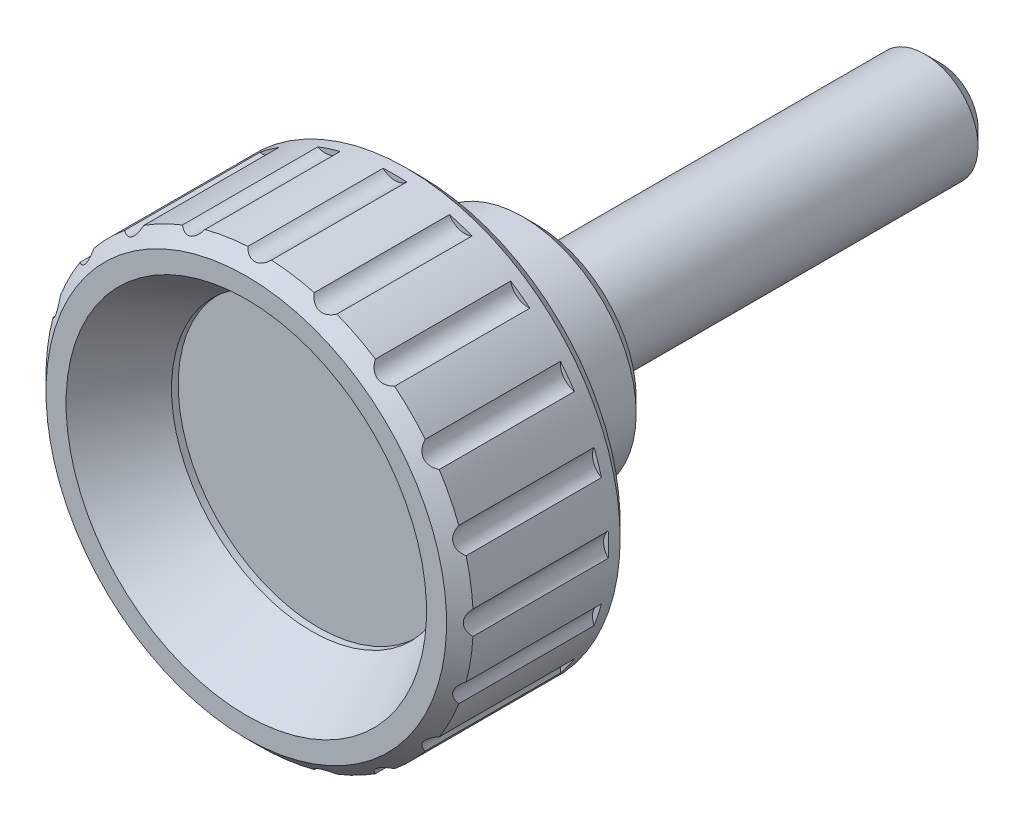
ISO-10303-21;
HEADER;
FILE_DESCRIPTION(('STEP AP214'),'2;1');
FILE_NAME('part.step','',(''),(''),'','','');
FILE_SCHEMA(('AUTOMOTIVE_DESIGN { 1 0 10303 214 1 1 1 1 }'));
ENDSEC;
DATA;
#1=APPLICATION_CONTEXT('core data for automotive mechanical design processes');
#2=APPLICATION_PROTOCOL_DEFINITION('international standard','automotive_design',2000,#1);
#3=PRODUCT_CONTEXT('',#1,'mechanical');
#4=PRODUCT('Part','Part','',(#3));
#5=PRODUCT_RELATED_PRODUCT_CATEGORY('part','',(#4));
#6=PRODUCT_DEFINITION_FORMATION('','',#4);
#7=PRODUCT_DEFINITION_CONTEXT('part definition',#1,'design');
#8=PRODUCT_DEFINITION('design','',#6,#7);
#9=PRODUCT_DEFINITION_SHAPE('','',#8);
#10=(LENGTH_UNIT() NAMED_UNIT(*) SI_UNIT(.MILLI.,.METRE.));
#11=(NAMED_UNIT(*) PLANE_ANGLE_UNIT() SI_UNIT($,.RADIAN.));
#12=(NAMED_UNIT(*) SI_UNIT($,.STERADIAN.) SOLID_ANGLE_UNIT());
#13=UNCERTAINTY_MEASURE_WITH_UNIT(LENGTH_MEASURE(1.E-05),#10,'distance_accuracy_value','');
#14=(GEOMETRIC_REPRESENTATION_CONTEXT(3) GLOBAL_UNCERTAINTY_ASSIGNED_CONTEXT((#13)) GLOBAL_UNIT_ASSIGNED_CONTEXT((#10,
#11,#12)) REPRESENTATION_CONTEXT('',''));
#15=CARTESIAN_POINT('',(0.,0.,0.));
#16=DIRECTION('',(0.,0.,1.));
#17=DIRECTION('',(1.,0.,0.));
#18=AXIS2_PLACEMENT_3D('',#15,#16,#17);
#19=CARTESIAN_POINT('',(0.,0.,0.));
#20=DIRECTION('',(0.,-3.55335756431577E-13,-1.));
#21=DIRECTION('',(0.,1.,-3.55335756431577E-13));
#22=AXIS2_PLACEMENT_3D('',#19,#20,#21);
#23=PLANE('',#22);
#24=CARTESIAN_POINT('',(0.,0.,0.));
#25=DIRECTION('',(0.,-3.55335756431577E-13,-1.));
#26=DIRECTION('',(0.,1.,-3.55335756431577E-13));
#27=AXIS2_PLACEMENT_3D('',#24,#25,#26);
#28=CIRCLE('',#27,5.);
#29=CARTESIAN_POINT('',(0.,5.,-1.77667878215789E-12));
#30=VERTEX_POINT('',#29);
#31=EDGE_CURVE('E1102',#30,#30,#28,.T.);
#32=ORIENTED_EDGE('',*,*,#31,.T.);
#33=EDGE_LOOP('',(#32));
#34=FACE_BOUND('',#33,.T.);
#35=CARTESIAN_POINT('',(0.,0.,0.));
#36=DIRECTION('',(0.,-3.55335756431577E-13,-1.));
#37=DIRECTION('',(0.,1.,-3.55335756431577E-13));
#38=AXIS2_PLACEMENT_3D('',#35,#36,#37);
#39=CIRCLE('',#38,4.);
#40=CARTESIAN_POINT('',(0.,4.,-1.42134302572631E-12));
#41=VERTEX_POINT('',#40);
#42=EDGE_CURVE('E1100',#41,#41,#39,.T.);
#43=ORIENTED_EDGE('',*,*,#42,.F.);
#44=EDGE_LOOP('',(#43));
#45=FACE_BOUND('',#44,.T.);
#46=ADVANCED_FACE('F14',(#34,#45),#23,.T.);
#47=CARTESIAN_POINT('',(-1.43127530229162E-12,7.46205088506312E-12,21.));
#48=DIRECTION('',(0.,-3.55335756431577E-13,-1.));
#49=DIRECTION('',(0.,1.,-3.55335756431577E-13));
#50=AXIS2_PLACEMENT_3D('',#47,#48,#49);
#51=CONICAL_SURFACE('',#50,16.,0.785398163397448);
#52=CARTESIAN_POINT('',(-1.49943126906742E-12,7.81738664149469E-12,22.));
#53=DIRECTION('',(0.,-3.55335756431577E-13,-1.));
#54=DIRECTION('',(0.,1.,-3.55335756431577E-13));
#55=AXIS2_PLACEMENT_3D('',#52,#53,#54);
#56=CIRCLE('',#55,15.);
#57=CARTESIAN_POINT('',(-1.49943126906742E-12,15.0000000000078,21.9999999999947));
#58=VERTEX_POINT('',#57);
#59=EDGE_CURVE('E582',#58,#58,#56,.T.);
#60=ORIENTED_EDGE('',*,*,#59,.T.);
#61=EDGE_LOOP('',(#60));
#62=FACE_BOUND('',#61,.T.);
#63=CARTESIAN_POINT('',(-1.43127530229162E-12,7.46205088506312E-12,21.));
#64=DIRECTION('',(0.,-3.55335756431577E-13,-1.));
#65=DIRECTION('',(0.,1.,-3.55335756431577E-13));
#66=AXIS2_PLACEMENT_3D('',#63,#64,#65);
#67=CIRCLE('',#66,16.);
#68=CARTESIAN_POINT('',(15.9753508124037,-0.887787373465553,21.0000000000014));
#69=VERTEX_POINT('',#68);
#70=CARTESIAN_POINT('',(15.4678028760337,-4.09231892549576,21.0000000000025));
#71=VERTEX_POINT('',#70);
#72=EDGE_CURVE('E587',#69,#71,#67,.T.);
#73=ORIENTED_EDGE('',*,*,#72,.F.);
#74=CARTESIAN_POINT('',(15.9755398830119,-0.887989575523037,20.9998000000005));
#75=CARTESIAN_POINT('',(15.9351784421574,-0.844826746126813,21.0424866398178));
#76=CARTESIAN_POINT('',(15.8966188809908,-0.797693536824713,21.0834537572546));
#77=CARTESIAN_POINT('',(15.8245769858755,-0.695019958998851,21.1602482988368));
#78=CARTESIAN_POINT('',(15.791150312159,-0.639398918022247,21.1960191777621));
#79=CARTESIAN_POINT('',(15.7380490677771,-0.532816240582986,21.2530008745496));
#80=CARTESIAN_POINT('',(15.7169614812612,-0.48337112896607,21.275690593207));
#81=CARTESIAN_POINT('',(15.6806455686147,-0.380207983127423,21.3148283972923));
#82=CARTESIAN_POINT('',(15.6653967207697,-0.326505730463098,21.3312983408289));
#83=CARTESIAN_POINT('',(15.6416857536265,-0.215315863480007,21.3569309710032));
#84=CARTESIAN_POINT('',(15.6332906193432,-0.157796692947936,21.366021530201));
#85=CARTESIAN_POINT('',(15.6243518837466,-0.0414082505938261,21.3757012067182));
#86=CARTESIAN_POINT('',(15.623808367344,0.0174610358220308,21.3762902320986));
#87=CARTESIAN_POINT('',(15.6301546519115,0.12624587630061,21.3694172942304));
#88=CARTESIAN_POINT('',(15.6360489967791,0.176295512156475,21.3630334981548));
#89=CARTESIAN_POINT('',(15.6532896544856,0.274274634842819,21.344383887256));
#90=CARTESIAN_POINT('',(15.6646343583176,0.322204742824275,21.33211980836));
#91=CARTESIAN_POINT('',(15.6925197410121,0.416525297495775,21.3020256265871));
#92=CARTESIAN_POINT('',(15.709218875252,0.462813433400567,21.2840259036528));
#93=CARTESIAN_POINT('',(15.7468524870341,0.551635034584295,21.2435491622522));
#94=CARTESIAN_POINT('',(15.7677958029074,0.594160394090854,21.2210628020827));
#95=CARTESIAN_POINT('',(15.8173070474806,0.682678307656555,21.168037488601));
#96=CARTESIAN_POINT('',(15.846568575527,0.727842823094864,21.1367787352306));
#97=CARTESIAN_POINT('',(15.9086393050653,0.812237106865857,21.0706895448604));
#98=CARTESIAN_POINT('',(15.9414255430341,0.851501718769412,21.0358822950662));
#99=CARTESIAN_POINT('',(15.9755398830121,0.887989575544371,20.9998));
#100=B_SPLINE_CURVE_WITH_KNOTS('',3,(#74,#75,#76,#77,#78,#79,#80,#81,#82,#83,#84,#85,#86,#87,
#88,#89,#90,#91,#92,#93,#94,#95,#96,#97,#98,#99),.UNSPECIFIED.,.F.,.F.,(4,2,2,2,2,2,2,2,2,2,2,2,
4),(0.,0.219100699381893,0.440431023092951,0.61478688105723,0.7885241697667,0.96393981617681,
1.13935735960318,1.29104866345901,1.44269521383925,1.59932369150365,1.75628175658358,
1.94245598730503,2.12748340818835),.UNSPECIFIED.);
#101=CARTESIAN_POINT('',(15.9753508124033,0.887787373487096,21.0000000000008));
#102=VERTEX_POINT('',#101);
#103=EDGE_CURVE('E588',#69,#102,#100,.T.);
#104=ORIENTED_EDGE('',*,*,#103,.T.);
#105=CARTESIAN_POINT('',(15.467802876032,4.09231892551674,20.9999999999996));
#106=VERTEX_POINT('',#105);
#107=EDGE_CURVE('E591',#106,#102,#67,.T.);
#108=ORIENTED_EDGE('',*,*,#107,.F.);
#109=CARTESIAN_POINT('',(15.4680028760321,4.09220841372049,20.9998349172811));
#110=CARTESIAN_POINT('',(15.4162815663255,4.12078731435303,21.0425185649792));
#111=CARTESIAN_POINT('',(15.3650471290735,4.15369881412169,21.0834826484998));
#112=CARTESIAN_POINT('',(15.2648091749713,4.22908574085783,21.1602711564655));
#113=CARTESIAN_POINT('',(15.2158336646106,4.27165508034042,21.1960390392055));
#114=CARTESIAN_POINT('',(15.1323998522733,4.35661227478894,21.2530163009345));
#115=CARTESIAN_POINT('',(15.0970664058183,4.39712151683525,21.2757043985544));
#116=CARTESIAN_POINT('',(15.030651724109,4.48401408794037,21.3148389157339));
#117=CARTESIAN_POINT('',(14.9995558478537,4.530376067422,21.3313071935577));
#118=CARTESIAN_POINT('',(14.9426490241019,4.62879687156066,21.3569365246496));
#119=CARTESIAN_POINT('',(14.9168920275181,4.68090639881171,21.3660254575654));
#120=CARTESIAN_POINT('',(14.8724279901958,4.78883525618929,21.3757021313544));
#121=CARTESIAN_POINT('',(14.8537210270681,4.84465462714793,21.3762897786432));
#122=CARTESIAN_POINT('',(14.8261428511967,4.95007522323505,21.3694146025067));
#123=CARTESIAN_POINT('',(14.8162835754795,4.9994964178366,21.363029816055));
#124=CARTESIAN_POINT('',(14.8024051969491,5.09800697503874,21.3443784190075));
#125=CARTESIAN_POINT('',(14.7983843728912,5.14709643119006,21.3321135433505));
#126=CARTESIAN_POINT('',(14.7957600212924,5.2454174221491,21.302017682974));
#127=CARTESIAN_POINT('',(14.7973389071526,5.29460058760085,21.2840169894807));
#128=CARTESIAN_POINT('',(14.8056849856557,5.39070462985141,21.243538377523));
#129=CARTESIAN_POINT('',(14.8124630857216,5.43762052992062,21.2210511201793));
#130=CARTESIAN_POINT('',(14.8321965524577,5.53709129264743,21.1680316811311));
#131=CARTESIAN_POINT('',(14.8460657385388,5.58907402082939,21.1367810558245));
#132=CARTESIAN_POINT('',(14.8790094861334,5.6884938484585,21.0707098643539));
#133=CARTESIAN_POINT('',(14.8980514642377,5.73595697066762,21.0359124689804));
#134=CARTESIAN_POINT('',(14.9192136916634,5.78119085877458,20.9998404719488));
#135=B_SPLINE_CURVE_WITH_KNOTS('',3,(#109,#110,#111,#112,#113,#114,#115,#116,#117,#118,#119,
#120,#121,#122,#123,#124,#125,#126,#127,#128,#129,#130,#131,#132,#133,#134),.UNSPECIFIED.,.F.,
.F.,(4,2,2,2,2,2,2,2,2,2,2,2,4),(0.,0.219090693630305,0.440410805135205,0.614763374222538,
0.788497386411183,0.963909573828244,1.13932369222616,1.29101393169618,1.44265944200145,
1.59928961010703,1.75624927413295,1.94237523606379,2.12735493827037),.UNSPECIFIED.);
#136=CARTESIAN_POINT('',(14.9191201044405,5.78099085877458,20.9999999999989));
#137=VERTEX_POINT('',#136);
#138=EDGE_CURVE('E276',#106,#137,#135,.T.);
#139=ORIENTED_EDGE('',*,*,#138,.T.);
#140=CARTESIAN_POINT('',(13.4461586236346,8.67184053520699,20.9999999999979));
#141=VERTEX_POINT('',#140);
#142=EDGE_CURVE('E594',#141,#137,#67,.T.);
#143=ORIENTED_EDGE('',*,*,#142,.F.);
#144=CARTESIAN_POINT('',(13.4463586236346,8.6718019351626,20.9998528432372));
#145=CARTESIAN_POINT('',(13.3883385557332,8.68300023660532,21.0425349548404));
#146=CARTESIAN_POINT('',(13.329442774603,8.69846942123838,21.0834974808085));
#147=CARTESIAN_POINT('',(13.2108177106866,8.73919269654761,21.1602828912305));
#148=CARTESIAN_POINT('',(13.151086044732,8.76454475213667,21.1960492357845));
#149=CARTESIAN_POINT('',(13.045484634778,8.81956217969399,21.2530242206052));
#150=CARTESIAN_POINT('',(12.9993630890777,8.84717062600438,21.275711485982));
#151=CARTESIAN_POINT('',(12.9093490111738,8.90928797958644,21.3148443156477));
#152=CARTESIAN_POINT('',(12.865449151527,8.94377205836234,21.3313117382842));
#153=CARTESIAN_POINT('',(12.7809154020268,9.0197911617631,21.3569393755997));
#154=CARTESIAN_POINT('',(12.7403171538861,9.06139107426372,21.3660274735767));
#155=CARTESIAN_POINT('',(12.6646792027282,9.15029744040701,21.3757026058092));
#156=CARTESIAN_POINT('',(12.6296395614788,9.19760395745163,21.3762895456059));
#157=CARTESIAN_POINT('',(12.5708357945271,9.28934266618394,21.3694132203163));
#158=CARTESIAN_POINT('',(12.5461876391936,9.33329835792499,21.3630279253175));
#159=CARTESIAN_POINT('',(12.5025481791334,9.42269874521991,21.3443756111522));
#160=CARTESIAN_POINT('',(12.4835552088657,9.46814299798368,21.3321103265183));
#161=CARTESIAN_POINT('',(12.4506773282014,9.56084100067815,21.3020136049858));
#162=CARTESIAN_POINT('',(12.4369809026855,9.6081051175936,21.2840124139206));
#163=CARTESIAN_POINT('',(12.4152215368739,9.70208497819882,21.2435328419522));
#164=CARTESIAN_POINT('',(12.4071705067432,9.7487993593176,21.2210451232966));
#165=CARTESIAN_POINT('',(12.3952016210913,9.84949409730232,21.168027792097));
#166=CARTESIAN_POINT('',(12.3923288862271,9.9032128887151,21.1367802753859));
#167=CARTESIAN_POINT('',(12.3929374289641,10.0079364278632,21.0707160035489));
#168=CARTESIAN_POINT('',(12.3963796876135,10.0589558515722,21.0359224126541));
#169=CARTESIAN_POINT('',(12.4025267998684,10.1085106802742,20.9998544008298));
#170=B_SPLINE_CURVE_WITH_KNOTS('',3,(#144,#145,#146,#147,#148,#149,#150,#151,#152,#153,#154,
#155,#156,#157,#158,#159,#160,#161,#162,#163,#164,#165,#166,#167,#168,#169),.UNSPECIFIED.,.F.,
.F.,(4,2,2,2,2,2,2,2,2,2,2,2,4),(0.,0.21908555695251,0.440400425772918,0.61475130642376,
0.788483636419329,0.963894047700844,1.1393064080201,1.29099610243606,1.4426410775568,
1.59927210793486,1.75623259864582,1.94233964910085,2.12730065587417),.UNSPECIFIED.);
#171=CARTESIAN_POINT('',(12.4025019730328,10.1083106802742,20.9999999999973));
#172=VERTEX_POINT('',#171);
#173=EDGE_CURVE('E517',#141,#172,#170,.T.);
#174=ORIENTED_EDGE('',*,*,#173,.T.);
#175=CARTESIAN_POINT('',(10.1083106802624,12.4025019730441,20.9999999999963));
#176=VERTEX_POINT('',#175);
#177=EDGE_CURVE('E1303',#176,#172,#67,.T.);
#178=ORIENTED_EDGE('',*,*,#177,.F.);
#179=CARTESIAN_POINT('',(10.1085106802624,12.4025267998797,20.9998544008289));
#180=CARTESIAN_POINT('',(10.0498699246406,12.3952479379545,21.042536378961));
#181=CARTESIAN_POINT('',(9.9890765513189,12.3917603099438,21.0834987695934));
#182=CARTESIAN_POINT('',(9.86367341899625,12.3938334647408,21.1602839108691));
#183=CARTESIAN_POINT('',(9.79903112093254,12.3994866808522,21.1960501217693));
#184=CARTESIAN_POINT('',(9.68159704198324,12.4191788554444,21.2530249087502));
#185=CARTESIAN_POINT('',(9.62920140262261,12.4311837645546,21.2757121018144));
#186=CARTESIAN_POINT('',(9.52439769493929,12.4624451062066,21.3148447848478));
#187=CARTESIAN_POINT('',(9.47199033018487,12.4816756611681,21.3313121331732));
#188=CARTESIAN_POINT('',(9.36810287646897,12.527851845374,21.3569396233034));
#189=CARTESIAN_POINT('',(9.31663663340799,12.5548702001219,21.3660276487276));
#190=CARTESIAN_POINT('',(9.21722722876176,12.6160518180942,21.3757026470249));
#191=CARTESIAN_POINT('',(9.16928410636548,12.6502151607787,21.3762895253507));
#192=CARTESIAN_POINT('',(9.08500969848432,12.7192925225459,21.3694131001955));
#193=CARTESIAN_POINT('',(9.04798489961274,12.7534801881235,21.3630277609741));
#194=CARTESIAN_POINT('',(8.97885516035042,12.825019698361,21.3443753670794));
#195=CARTESIAN_POINT('',(8.94674877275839,12.8623706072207,21.3321100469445));
#196=CARTESIAN_POINT('',(8.8868348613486,12.9403718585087,21.3020132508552));
#197=CARTESIAN_POINT('',(8.85920339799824,12.9810903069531,21.2840120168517));
#198=CARTESIAN_POINT('',(8.80946769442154,13.0637465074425,21.243532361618));
#199=CARTESIAN_POINT('',(8.78737520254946,13.1056866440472,21.2210446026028));
#200=CARTESIAN_POINT('',(8.74487571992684,13.1977546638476,21.1680270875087));
#201=CARTESIAN_POINT('',(8.72554355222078,13.247956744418,21.1367794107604));
#202=CARTESIAN_POINT('',(8.69376097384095,13.3477431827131,21.0707148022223));
#203=CARTESIAN_POINT('',(8.68126891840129,13.3973294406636,21.0359210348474));
#204=CARTESIAN_POINT('',(8.67180193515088,13.4463586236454,20.9998528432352));
#205=B_SPLINE_CURVE_WITH_KNOTS('',3,(#179,#180,#181,#182,#183,#184,#185,#186,#187,#188,#189,
#190,#191,#192,#193,#194,#195,#196,#197,#198,#199,#200,#201,#202,#203,#204),.UNSPECIFIED.,.F.,
.F.,(4,2,2,2,2,2,2,2,2,2,2,2,4),(0.,0.219085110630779,0.440399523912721,0.614750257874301,
0.788482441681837,0.963892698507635,1.13930490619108,1.29099455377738,1.44263948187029,
1.599270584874,1.75623114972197,1.94233892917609,2.12730065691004),.UNSPECIFIED.);
#206=CARTESIAN_POINT('',(8.67184053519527,13.4461586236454,20.9999999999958));
#207=VERTEX_POINT('',#206);
#208=EDGE_CURVE('E1293',#176,#207,#205,.T.);
#209=ORIENTED_EDGE('',*,*,#208,.T.);
#210=CARTESIAN_POINT('',(5.78099085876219,14.9191201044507,20.9999999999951));
#211=VERTEX_POINT('',#210);
#212=EDGE_CURVE('E601',#211,#207,#67,.T.);
#213=ORIENTED_EDGE('',*,*,#212,.F.);
#214=CARTESIAN_POINT('',(5.78119085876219,14.9192136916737,20.9998404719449));
#215=CARTESIAN_POINT('',(5.72766915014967,14.8941689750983,21.0425236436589));
#216=CARTESIAN_POINT('',(5.67092851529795,14.872064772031,21.0834872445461));
#217=CARTESIAN_POINT('',(5.5510212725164,14.8352827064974,21.1602747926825));
#218=CARTESIAN_POINT('',(5.48779515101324,14.8206827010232,21.1960421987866));
#219=CARTESIAN_POINT('',(5.37002254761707,14.8031204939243,21.2530187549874));
#220=CARTESIAN_POINT('',(5.31648146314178,14.7983461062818,21.2757065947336));
#221=CARTESIAN_POINT('',(5.20714649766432,14.7956901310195,21.3148405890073));
#222=CARTESIAN_POINT('',(5.15136128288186,14.7977841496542,21.3313086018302));
#223=CARTESIAN_POINT('',(5.03828848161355,14.8095962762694,21.3569374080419));
#224=CARTESIAN_POINT('',(4.98099158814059,14.8193878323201,21.3660260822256));
#225=CARTESIAN_POINT('',(4.86754042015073,14.8468549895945,21.3757022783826));
#226=CARTESIAN_POINT('',(4.81138615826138,14.8645306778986,21.3762897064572));
#227=CARTESIAN_POINT('',(4.7098894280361,14.9041843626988,21.3694141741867));
#228=CARTESIAN_POINT('',(4.66411184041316,14.9252571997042,21.3630292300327));
#229=CARTESIAN_POINT('',(4.5762579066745,14.971932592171,21.344377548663));
#230=CARTESIAN_POINT('',(4.53418047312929,14.9975338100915,21.3321125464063));
#231=CARTESIAN_POINT('',(4.45309476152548,15.0532024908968,21.3020164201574));
#232=CARTESIAN_POINT('',(4.41423284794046,15.0833891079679,21.2840155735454));
#233=CARTESIAN_POINT('',(4.3413888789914,15.1466300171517,21.2435366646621));
#234=CARTESIAN_POINT('',(4.30741726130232,15.1796902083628,21.2210492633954));
#235=CARTESIAN_POINT('',(4.2385424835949,15.2541231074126,21.1680291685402));
#236=CARTESIAN_POINT('',(4.20463940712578,15.2958988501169,21.136777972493));
#237=CARTESIAN_POINT('',(4.1435705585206,15.3809897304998,21.0707055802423));
#238=CARTESIAN_POINT('',(4.11636458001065,15.4242938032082,21.0359075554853));
#239=CARTESIAN_POINT('',(4.09220841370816,15.4680028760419,20.9998349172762));
#240=B_SPLINE_CURVE_WITH_KNOTS('',3,(#214,#215,#216,#217,#218,#219,#220,#221,#222,#223,#224,
#225,#226,#227,#228,#229,#230,#231,#232,#233,#234,#235,#236,#237,#238,#239),.UNSPECIFIED.,.F.,
.F.,(4,2,2,2,2,2,2,2,2,2,2,2,4),(0.,0.21908910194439,0.440407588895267,0.614759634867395,
0.78849312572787,0.963904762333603,1.13931833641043,1.29100840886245,1.44265375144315,
1.59928417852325,1.7562441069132,1.9423726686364,2.12735494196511),.UNSPECIFIED.);
#241=CARTESIAN_POINT('',(4.09231892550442,15.4678028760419,20.9999999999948));
#242=VERTEX_POINT('',#241);
#243=EDGE_CURVE('E1285',#211,#242,#240,.T.);
#244=ORIENTED_EDGE('',*,*,#243,.T.);
#245=CARTESIAN_POINT('',(0.887787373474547,15.9753508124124,20.9999999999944));
#246=VERTEX_POINT('',#245);
#247=EDGE_CURVE('E597',#246,#242,#67,.T.);
#248=ORIENTED_EDGE('',*,*,#247,.F.);
#249=CARTESIAN_POINT('',(0.887987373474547,15.9755378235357,20.9998021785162));
#250=CARTESIAN_POINT('',(0.844824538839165,15.9351765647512,21.0424886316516));
#251=CARTESIAN_POINT('',(0.797691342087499,15.8966171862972,21.0834555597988));
#252=CARTESIAN_POINT('',(0.695017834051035,15.8245756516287,21.1602497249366));
#253=CARTESIAN_POINT('',(0.639396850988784,15.7911491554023,21.1960204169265));
#254=CARTESIAN_POINT('',(0.532814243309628,15.7380481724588,21.2530018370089));
#255=CARTESIAN_POINT('',(0.483369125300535,15.716960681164,21.2756914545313));
#256=CARTESIAN_POINT('',(0.380205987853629,15.6806449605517,21.3148290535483));
#257=CARTESIAN_POINT('',(0.326503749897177,15.665396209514,21.3312988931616));
#258=CARTESIAN_POINT('',(0.215313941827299,15.6416854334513,21.3569313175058));
#259=CARTESIAN_POINT('',(0.157794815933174,15.6332903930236,21.3660217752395));
#260=CARTESIAN_POINT('',(0.0414064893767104,15.6243518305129,21.3757012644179));
#261=CARTESIAN_POINT('',(-0.0174627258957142,15.6238083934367,21.3762902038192));
#262=CARTESIAN_POINT('',(-0.1262474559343,15.6301548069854,21.3694171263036));
#263=CARTESIAN_POINT('',(-0.176297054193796,15.6360492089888,21.3630332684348));
#264=CARTESIAN_POINT('',(-0.274276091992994,15.6532899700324,21.3443835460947));
#265=CARTESIAN_POINT('',(-0.322206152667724,15.664634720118,21.332119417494));
#266=CARTESIAN_POINT('',(-0.416526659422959,15.6925202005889,21.3020251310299));
#267=CARTESIAN_POINT('',(-0.462814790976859,15.7092193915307,21.2840253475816));
#268=CARTESIAN_POINT('',(-0.551636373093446,15.7468531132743,21.2435484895));
#269=CARTESIAN_POINT('',(-0.594161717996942,15.7677964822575,21.2210620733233));
#270=CARTESIAN_POINT('',(-0.682678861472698,15.8173074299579,21.1680370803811));
#271=CARTESIAN_POINT('',(-0.72784270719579,15.8465685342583,21.1367787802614));
#272=CARTESIAN_POINT('',(-0.812235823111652,15.9086383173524,21.0706905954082));
#273=CARTESIAN_POINT('',(-0.851499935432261,15.9414240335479,21.0358838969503));
#274=CARTESIAN_POINT('',(-0.887987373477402,15.9755378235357,20.999802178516));
#275=B_SPLINE_CURVE_WITH_KNOTS('',3,(#249,#250,#251,#252,#253,#254,#255,#256,#257,#258,#259,
#260,#261,#262,#263,#264,#265,#266,#267,#268,#269,#270,#271,#272,#273,#274),.UNSPECIFIED.,.F.,
.F.,(4,2,2,2,2,2,2,2,2,2,2,2,4),(0.,0.219100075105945,0.440429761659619,0.614785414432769,
0.788522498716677,0.963937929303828,1.13935525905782,1.29104649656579,1.44269298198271,
1.59932156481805,1.75627972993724,1.94245124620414,2.12747598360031),.UNSPECIFIED.);
#276=CARTESIAN_POINT('',(-0.887787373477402,15.9753508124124,20.9999999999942));
#277=VERTEX_POINT('',#276);
#278=EDGE_CURVE('E1278',#246,#277,#275,.T.);
#279=ORIENTED_EDGE('',*,*,#278,.T.);
#280=CARTESIAN_POINT('',(-4.09231892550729,15.4678028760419,20.9999999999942));
#281=VERTEX_POINT('',#280);
#282=EDGE_CURVE('E602',#281,#277,#67,.T.);
#283=ORIENTED_EDGE('',*,*,#282,.F.);
#284=CARTESIAN_POINT('',(-4.09220841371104,15.4680028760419,20.9998349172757));
#285=CARTESIAN_POINT('',(-4.12078731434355,15.4162815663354,21.0425185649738));
#286=CARTESIAN_POINT('',(-4.15369881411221,15.3650471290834,21.0834826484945));
#287=CARTESIAN_POINT('',(-4.22908574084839,15.2648091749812,21.1602711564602));
#288=CARTESIAN_POINT('',(-4.271655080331,15.2158336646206,21.1960390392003));
#289=CARTESIAN_POINT('',(-4.35661227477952,15.1323998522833,21.2530163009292));
#290=CARTESIAN_POINT('',(-4.39712151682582,15.0970664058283,21.2757043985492));
#291=CARTESIAN_POINT('',(-4.48401408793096,15.0306517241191,21.3148389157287));
#292=CARTESIAN_POINT('',(-4.53037606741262,14.9995558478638,21.3313071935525));
#293=CARTESIAN_POINT('',(-4.6287968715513,14.942649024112,21.3569365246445));
#294=CARTESIAN_POINT('',(-4.68090639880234,14.9168920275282,21.3660254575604));
#295=CARTESIAN_POINT('',(-4.78883525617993,14.872427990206,21.3757021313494));
#296=CARTESIAN_POINT('',(-4.84465462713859,14.8537210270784,21.3762897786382));
#297=CARTESIAN_POINT('',(-4.95007522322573,14.826142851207,21.3694146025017));
#298=CARTESIAN_POINT('',(-4.99949641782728,14.8162835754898,21.3630298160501));
#299=CARTESIAN_POINT('',(-5.09800697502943,14.8024051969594,21.3443784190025));
#300=CARTESIAN_POINT('',(-5.14709643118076,14.7983843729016,21.3321135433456));
#301=CARTESIAN_POINT('',(-5.24541742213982,14.7957600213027,21.3020176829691));
#302=CARTESIAN_POINT('',(-5.29460058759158,14.797338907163,21.2840169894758));
#303=CARTESIAN_POINT('',(-5.39070462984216,14.805684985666,21.2435383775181));
#304=CARTESIAN_POINT('',(-5.43762052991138,14.8124630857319,21.2210511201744));
#305=CARTESIAN_POINT('',(-5.53709129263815,14.832196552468,21.1680316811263));
#306=CARTESIAN_POINT('',(-5.58907402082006,14.8460657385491,21.1367810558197));
#307=CARTESIAN_POINT('',(-5.68849384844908,14.8790094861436,21.0707098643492));
#308=CARTESIAN_POINT('',(-5.73595697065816,14.8980514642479,21.0359124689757));
#309=CARTESIAN_POINT('',(-5.78119085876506,14.9192136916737,20.9998404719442));
#310=B_SPLINE_CURVE_WITH_KNOTS('',3,(#284,#285,#286,#287,#288,#289,#290,#291,#292,#293,#294,
#295,#296,#297,#298,#299,#300,#301,#302,#303,#304,#305,#306,#307,#308,#309),.UNSPECIFIED.,.F.,
.F.,(4,2,2,2,2,2,2,2,2,2,2,2,4),(0.,0.219090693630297,0.440410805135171,0.614763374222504,
0.788497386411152,0.96390957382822,1.13932369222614,1.29101393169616,1.44265944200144,
1.59928961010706,1.75624927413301,1.94237523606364,2.12735493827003),.UNSPECIFIED.);
#311=CARTESIAN_POINT('',(-5.78099085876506,14.9191201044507,20.9999999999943));
#312=VERTEX_POINT('',#311);
#313=EDGE_CURVE('E1271',#281,#312,#310,.T.);
#314=ORIENTED_EDGE('',*,*,#313,.T.);
#315=CARTESIAN_POINT('',(-8.67184053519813,13.4461586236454,20.9999999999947));
#316=VERTEX_POINT('',#315);
#317=EDGE_CURVE('E1140',#316,#312,#67,.T.);
#318=ORIENTED_EDGE('',*,*,#317,.F.);
#319=CARTESIAN_POINT('',(-8.67180193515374,13.4463586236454,20.999852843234));
#320=CARTESIAN_POINT('',(-8.68300023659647,13.3883385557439,21.0425349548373));
#321=CARTESIAN_POINT('',(-8.69846942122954,13.3294427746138,21.0834974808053));
#322=CARTESIAN_POINT('',(-8.73919269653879,13.2108177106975,21.1602828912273));
#323=CARTESIAN_POINT('',(-8.76454475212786,13.1510860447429,21.1960492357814));
#324=CARTESIAN_POINT('',(-8.81956217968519,13.0454846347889,21.253024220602));
#325=CARTESIAN_POINT('',(-8.84717062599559,12.9993630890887,21.2757114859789));
#326=CARTESIAN_POINT('',(-8.90928797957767,12.9093490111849,21.3148443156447));
#327=CARTESIAN_POINT('',(-8.94377205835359,12.8654491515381,21.3313117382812));
#328=CARTESIAN_POINT('',(-9.01979116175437,12.780915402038,21.3569393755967));
#329=CARTESIAN_POINT('',(-9.06139107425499,12.7403171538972,21.3660274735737));
#330=CARTESIAN_POINT('',(-9.1502974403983,12.6646792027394,21.3757026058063));
#331=CARTESIAN_POINT('',(-9.19760395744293,12.62963956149,21.376289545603));
#332=CARTESIAN_POINT('',(-9.28934266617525,12.5708357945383,21.3694132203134));
#333=CARTESIAN_POINT('',(-9.3332983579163,12.5461876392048,21.3630279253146));
#334=CARTESIAN_POINT('',(-9.42269874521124,12.5025481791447,21.3443756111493));
#335=CARTESIAN_POINT('',(-9.46814299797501,12.483555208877,21.3321103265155));
#336=CARTESIAN_POINT('',(-9.56084100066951,12.4506773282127,21.302013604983));
#337=CARTESIAN_POINT('',(-9.60810511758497,12.4369809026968,21.2840124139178));
#338=CARTESIAN_POINT('',(-9.70208497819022,12.4152215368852,21.2435328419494));
#339=CARTESIAN_POINT('',(-9.74879935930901,12.4071705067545,21.2210451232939));
#340=CARTESIAN_POINT('',(-9.84949409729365,12.3952016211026,21.1680277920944));
#341=CARTESIAN_POINT('',(-9.90321288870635,12.3923288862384,21.1367802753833));
#342=CARTESIAN_POINT('',(-10.0079364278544,12.3929374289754,21.0707160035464));
#343=CARTESIAN_POINT('',(-10.0589558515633,12.3963796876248,21.0359224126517));
#344=CARTESIAN_POINT('',(-10.1085106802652,12.4025267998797,20.9998544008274));
#345=B_SPLINE_CURVE_WITH_KNOTS('',3,(#319,#320,#321,#322,#323,#324,#325,#326,#327,#328,#329,
#330,#331,#332,#333,#334,#335,#336,#337,#338,#339,#340,#341,#342,#343,#344),.UNSPECIFIED.,.F.,
.F.,(4,2,2,2,2,2,2,2,2,2,2,2,4),(0.,0.21908555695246,0.440400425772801,0.614751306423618,
0.78848363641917,0.96389404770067,1.13930640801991,1.29099610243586,1.4426410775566,
1.59927210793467,1.75623259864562,1.94233964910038,2.12730065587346),.UNSPECIFIED.);
#346=CARTESIAN_POINT('',(-10.1083106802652,12.4025019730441,20.9999999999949));
#347=VERTEX_POINT('',#346);
#348=EDGE_CURVE('E1264',#316,#347,#345,.T.);
#349=ORIENTED_EDGE('',*,*,#348,.T.);
#350=CARTESIAN_POINT('',(-12.402501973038,10.1083106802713,20.9999999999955));
#351=VERTEX_POINT('',#350);
#352=EDGE_CURVE('E1143',#351,#347,#67,.T.);
#353=ORIENTED_EDGE('',*,*,#352,.F.);
#354=CARTESIAN_POINT('',(-12.4025267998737,10.1085106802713,20.9998544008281));
#355=CARTESIAN_POINT('',(-12.3952479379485,10.0498699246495,21.0425363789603));
#356=CARTESIAN_POINT('',(-12.3917603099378,9.98907655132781,21.0834987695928));
#357=CARTESIAN_POINT('',(-12.3938334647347,9.86367341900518,21.1602839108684));
#358=CARTESIAN_POINT('',(-12.3994866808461,9.79903112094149,21.1960501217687));
#359=CARTESIAN_POINT('',(-12.4191788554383,9.6815970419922,21.2530249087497));
#360=CARTESIAN_POINT('',(-12.4311837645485,9.62920140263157,21.2757121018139));
#361=CARTESIAN_POINT('',(-12.4624451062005,9.52439769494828,21.3148447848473));
#362=CARTESIAN_POINT('',(-12.481675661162,9.47199033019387,21.3313121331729));
#363=CARTESIAN_POINT('',(-12.5278518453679,9.36810287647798,21.356939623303));
#364=CARTESIAN_POINT('',(-12.5548702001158,9.316636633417,21.3660276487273));
#365=CARTESIAN_POINT('',(-12.6160518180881,9.21722722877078,21.3757026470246));
#366=CARTESIAN_POINT('',(-12.6502151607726,9.1692841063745,21.3762895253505));
#367=CARTESIAN_POINT('',(-12.7192925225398,9.08500969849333,21.3694131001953));
#368=CARTESIAN_POINT('',(-12.7534801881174,9.04798489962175,21.363027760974));
#369=CARTESIAN_POINT('',(-12.8250196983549,8.97885516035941,21.3443753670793));
#370=CARTESIAN_POINT('',(-12.8623706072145,8.94674877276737,21.3321100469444));
#371=CARTESIAN_POINT('',(-12.9403718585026,8.88683486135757,21.3020132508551));
#372=CARTESIAN_POINT('',(-12.9810903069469,8.8592033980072,21.2840120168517));
#373=CARTESIAN_POINT('',(-13.0637465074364,8.8094676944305,21.243532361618));
#374=CARTESIAN_POINT('',(-13.1056866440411,8.78737520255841,21.2210446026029));
#375=CARTESIAN_POINT('',(-13.1977546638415,8.74487571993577,21.1680270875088));
#376=CARTESIAN_POINT('',(-13.247956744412,8.72554355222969,21.1367794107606));
#377=CARTESIAN_POINT('',(-13.347743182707,8.69376097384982,21.0707148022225));
#378=CARTESIAN_POINT('',(-13.3973294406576,8.68126891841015,21.0359210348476));
#379=CARTESIAN_POINT('',(-13.4463586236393,8.67180193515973,20.9998528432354));
#380=B_SPLINE_CURVE_WITH_KNOTS('',3,(#354,#355,#356,#357,#358,#359,#360,#361,#362,#363,#364,
#365,#366,#367,#368,#369,#370,#371,#372,#373,#374,#375,#376,#377,#378,#379),.UNSPECIFIED.,.F.,
.F.,(4,2,2,2,2,2,2,2,2,2,2,2,4),(0.,0.219085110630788,0.440399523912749,0.614750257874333,
0.788482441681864,0.963892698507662,1.13930490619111,1.29099455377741,1.44263948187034,
1.59927058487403,1.75623114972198,1.94233892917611,2.12730065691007),.UNSPECIFIED.);
#381=CARTESIAN_POINT('',(-13.4461586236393,8.67184053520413,20.999999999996));
#382=VERTEX_POINT('',#381);
#383=EDGE_CURVE('E1254',#351,#382,#380,.T.);
#384=ORIENTED_EDGE('',*,*,#383,.T.);
#385=CARTESIAN_POINT('',(-14.9191201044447,5.78099085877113,20.999999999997));
#386=VERTEX_POINT('',#385);
#387=EDGE_CURVE('E1146',#386,#382,#67,.T.);
#388=ORIENTED_EDGE('',*,*,#387,.F.);
#389=CARTESIAN_POINT('',(-14.9192136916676,5.78119085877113,20.9998404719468));
#390=CARTESIAN_POINT('',(-14.8941689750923,5.7276691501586,21.0425236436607));
#391=CARTESIAN_POINT('',(-14.8720647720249,5.6709285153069,21.0834872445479));
#392=CARTESIAN_POINT('',(-14.8352827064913,5.5510212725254,21.1602747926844));
#393=CARTESIAN_POINT('',(-14.8206827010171,5.48779515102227,21.1960421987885));
#394=CARTESIAN_POINT('',(-14.8031204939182,5.37002254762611,21.2530187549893));
#395=CARTESIAN_POINT('',(-14.7983461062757,5.31648146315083,21.2757065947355));
#396=CARTESIAN_POINT('',(-14.7956901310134,5.20714649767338,21.3148405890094));
#397=CARTESIAN_POINT('',(-14.797784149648,5.15136128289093,21.3313086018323));
#398=CARTESIAN_POINT('',(-14.8095962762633,5.03828848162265,21.356937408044));
#399=CARTESIAN_POINT('',(-14.819387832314,4.9809915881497,21.3660260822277));
#400=CARTESIAN_POINT('',(-14.8468549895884,4.86754042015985,21.3757022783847));
#401=CARTESIAN_POINT('',(-14.8645306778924,4.81138615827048,21.3762897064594));
#402=CARTESIAN_POINT('',(-14.9041843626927,4.70988942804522,21.369414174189));
#403=CARTESIAN_POINT('',(-14.9252571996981,4.66411184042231,21.363029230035));
#404=CARTESIAN_POINT('',(-14.9719325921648,4.57625790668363,21.3443775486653));
#405=CARTESIAN_POINT('',(-14.9975338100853,4.53418047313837,21.3321125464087));
#406=CARTESIAN_POINT('',(-15.0532024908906,4.45309476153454,21.3020164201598));
#407=CARTESIAN_POINT('',(-15.0833891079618,4.41423284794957,21.2840155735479));
#408=CARTESIAN_POINT('',(-15.1466300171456,4.3413888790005,21.2435366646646));
#409=CARTESIAN_POINT('',(-15.1796902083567,4.30741726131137,21.2210492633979));
#410=CARTESIAN_POINT('',(-15.2541231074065,4.2385424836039,21.1680291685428));
#411=CARTESIAN_POINT('',(-15.2958988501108,4.20463940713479,21.1367779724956));
#412=CARTESIAN_POINT('',(-15.3809897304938,4.14357055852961,21.0707055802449));
#413=CARTESIAN_POINT('',(-15.4242938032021,4.11636458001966,21.0359075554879));
#414=CARTESIAN_POINT('',(-15.4680028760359,4.0922084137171,20.9998349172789));
#415=B_SPLINE_CURVE_WITH_KNOTS('',3,(#389,#390,#391,#392,#393,#394,#395,#396,#397,#398,#399,
#400,#401,#402,#403,#404,#405,#406,#407,#408,#409,#410,#411,#412,#413,#414),.UNSPECIFIED.,.F.,
.F.,(4,2,2,2,2,2,2,2,2,2,2,2,4),(0.,0.219089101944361,0.440407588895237,0.614759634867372,
0.788493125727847,0.963904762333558,1.13931833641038,1.29100840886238,1.44265375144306,
1.59928417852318,1.75624410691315,1.94237266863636,2.12735494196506),.UNSPECIFIED.);
#416=CARTESIAN_POINT('',(-15.4678028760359,4.09231892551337,20.9999999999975));
#417=VERTEX_POINT('',#416);
#418=EDGE_CURVE('E1247',#386,#417,#415,.T.);
#419=ORIENTED_EDGE('',*,*,#418,.T.);
#420=CARTESIAN_POINT('',(-15.9753508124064,0.887787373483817,20.9999999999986));
#421=VERTEX_POINT('',#420);
#422=EDGE_CURVE('E1149',#421,#417,#67,.T.);
#423=ORIENTED_EDGE('',*,*,#422,.F.);
#424=CARTESIAN_POINT('',(-15.9755398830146,0.887989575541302,20.9997999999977));
#425=CARTESIAN_POINT('',(-15.9351784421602,0.84482674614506,21.042486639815));
#426=CARTESIAN_POINT('',(-15.8966188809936,0.797693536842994,21.0834537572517));
#427=CARTESIAN_POINT('',(-15.8245769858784,0.695019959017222,21.160248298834));
#428=CARTESIAN_POINT('',(-15.791150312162,0.639398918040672,21.1960191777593));
#429=CARTESIAN_POINT('',(-15.7380490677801,0.53281624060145,21.2530008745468));
#430=CARTESIAN_POINT('',(-15.7169614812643,0.483371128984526,21.2756905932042));
#431=CARTESIAN_POINT('',(-15.6806455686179,0.380207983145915,21.3148283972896));
#432=CARTESIAN_POINT('',(-15.6653967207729,0.326505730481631,21.3312983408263));
#433=CARTESIAN_POINT('',(-15.6416857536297,0.215315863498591,21.3569309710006));
#434=CARTESIAN_POINT('',(-15.6332906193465,0.157796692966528,21.3660215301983));
#435=CARTESIAN_POINT('',(-15.62435188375,0.0414082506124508,21.3757012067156));
#436=CARTESIAN_POINT('',(-15.6238083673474,-0.0174610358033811,21.376290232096));
#437=CARTESIAN_POINT('',(-15.6301546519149,-0.126245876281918,21.3694172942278));
#438=CARTESIAN_POINT('',(-15.6360489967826,-0.176295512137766,21.3630334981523));
#439=CARTESIAN_POINT('',(-15.6532896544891,-0.274274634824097,21.3443838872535));
#440=CARTESIAN_POINT('',(-15.6646343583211,-0.322204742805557,21.3321198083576));
#441=CARTESIAN_POINT('',(-15.6925197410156,-0.416525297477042,21.3020256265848));
#442=CARTESIAN_POINT('',(-15.7092188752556,-0.462813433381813,21.2840259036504));
#443=CARTESIAN_POINT('',(-15.7468524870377,-0.551635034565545,21.2435491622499));
#444=CARTESIAN_POINT('',(-15.767795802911,-0.594160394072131,21.2210628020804));
#445=CARTESIAN_POINT('',(-15.8173070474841,-0.682678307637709,21.1680374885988));
#446=CARTESIAN_POINT('',(-15.8465685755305,-0.727842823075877,21.1367787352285));
#447=CARTESIAN_POINT('',(-15.9086393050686,-0.812237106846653,21.0706895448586));
#448=CARTESIAN_POINT('',(-15.9414255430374,-0.851501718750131,21.0358822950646));
#449=CARTESIAN_POINT('',(-15.9755398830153,-0.887989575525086,20.9997999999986));
#450=B_SPLINE_CURVE_WITH_KNOTS('',3,(#424,#425,#426,#427,#428,#429,#430,#431,#432,#433,#434,
#435,#436,#437,#438,#439,#440,#441,#442,#443,#444,#445,#446,#447,#448,#449),.UNSPECIFIED.,.F.,
.F.,(4,2,2,2,2,2,2,2,2,2,2,2,4),(0.,0.219100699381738,0.440431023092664,0.614786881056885,
0.788524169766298,0.963939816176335,1.13935735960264,1.29104866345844,1.44269521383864,
1.59932369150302,1.75628175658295,1.94245598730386,2.12748340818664),.UNSPECIFIED.);
#451=CARTESIAN_POINT('',(-15.9753508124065,-0.887787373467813,20.9999999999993));
#452=VERTEX_POINT('',#451);
#453=EDGE_CURVE('E1240',#421,#452,#450,.T.);
#454=ORIENTED_EDGE('',*,*,#453,.T.);
#455=CARTESIAN_POINT('',(-15.467802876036,-4.09231892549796,21.0000000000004));
#456=VERTEX_POINT('',#455);
#457=EDGE_CURVE('E1152',#456,#452,#67,.T.);
#458=ORIENTED_EDGE('',*,*,#457,.F.);
#459=CARTESIAN_POINT('',(-15.468002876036,-4.09220841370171,20.9998349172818));
#460=CARTESIAN_POINT('',(-15.4162815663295,-4.12078731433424,21.04251856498));
#461=CARTESIAN_POINT('',(-15.3650471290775,-4.15369881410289,21.0834826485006));
#462=CARTESIAN_POINT('',(-15.2648091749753,-4.229085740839,21.1602711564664));
#463=CARTESIAN_POINT('',(-15.2158336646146,-4.27165508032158,21.1960390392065));
#464=CARTESIAN_POINT('',(-15.1323998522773,-4.35661227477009,21.2530163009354));
#465=CARTESIAN_POINT('',(-15.0970664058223,-4.39712151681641,21.2757043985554));
#466=CARTESIAN_POINT('',(-15.0306517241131,-4.48401408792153,21.314838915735));
#467=CARTESIAN_POINT('',(-14.9995558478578,-4.53037606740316,21.3313071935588));
#468=CARTESIAN_POINT('',(-14.942649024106,-4.62879687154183,21.3569365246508));
#469=CARTESIAN_POINT('',(-14.9168920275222,-4.68090639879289,21.3660254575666));
#470=CARTESIAN_POINT('',(-14.8724279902,-4.78883525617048,21.3757021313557));
#471=CARTESIAN_POINT('',(-14.8537210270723,-4.84465462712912,21.3762897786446));
#472=CARTESIAN_POINT('',(-14.8261428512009,-4.95007522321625,21.3694146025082));
#473=CARTESIAN_POINT('',(-14.8162835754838,-4.99949641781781,21.3630298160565));
#474=CARTESIAN_POINT('',(-14.8024051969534,-5.09800697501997,21.344378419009));
#475=CARTESIAN_POINT('',(-14.7983843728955,-5.14709643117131,21.332113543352));
#476=CARTESIAN_POINT('',(-14.7957600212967,-5.24541742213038,21.3020176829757));
#477=CARTESIAN_POINT('',(-14.797338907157,-5.29460058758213,21.2840169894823));
#478=CARTESIAN_POINT('',(-14.80568498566,-5.39070462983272,21.2435383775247));
#479=CARTESIAN_POINT('',(-14.8124630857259,-5.43762052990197,21.221051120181));
#480=CARTESIAN_POINT('',(-14.832196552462,-5.53709129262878,21.168031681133));
#481=CARTESIAN_POINT('',(-14.8460657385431,-5.5890740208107,21.1367810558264));
#482=CARTESIAN_POINT('',(-14.8790094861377,-5.68849384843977,21.0707098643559));
#483=CARTESIAN_POINT('',(-14.8980514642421,-5.73595697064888,21.0359124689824));
#484=CARTESIAN_POINT('',(-14.9192136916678,-5.78119085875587,20.9998404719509));
#485=B_SPLINE_CURVE_WITH_KNOTS('',3,(#459,#460,#461,#462,#463,#464,#465,#466,#467,#468,#469,
#470,#471,#472,#473,#474,#475,#476,#477,#478,#479,#480,#481,#482,#483,#484),.UNSPECIFIED.,.F.,
.F.,(4,2,2,2,2,2,2,2,2,2,2,2,4),(0.,0.219090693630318,0.440410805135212,0.614763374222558,
0.788497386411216,0.96390957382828,1.1393236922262,1.29101393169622,1.4426594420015,
1.5992896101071,1.75624927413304,1.94237523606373,2.12735493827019),.UNSPECIFIED.);
#486=CARTESIAN_POINT('',(-14.9191201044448,-5.78099085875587,21.0000000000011));
#487=VERTEX_POINT('',#486);
#488=EDGE_CURVE('E1233',#456,#487,#485,.T.);
#489=ORIENTED_EDGE('',*,*,#488,.T.);
#490=CARTESIAN_POINT('',(-13.4461586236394,-8.6718405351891,21.0000000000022));
#491=VERTEX_POINT('',#490);
#492=EDGE_CURVE('E1155',#491,#487,#67,.T.);
#493=ORIENTED_EDGE('',*,*,#492,.F.);
#494=CARTESIAN_POINT('',(-13.4463586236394,-8.67180193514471,20.9998528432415));
#495=CARTESIAN_POINT('',(-13.3883385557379,-8.68300023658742,21.0425349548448));
#496=CARTESIAN_POINT('',(-13.3294427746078,-8.69846942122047,21.0834974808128));
#497=CARTESIAN_POINT('',(-13.2108177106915,-8.73919269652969,21.1602828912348));
#498=CARTESIAN_POINT('',(-13.1510860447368,-8.76454475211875,21.1960492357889));
#499=CARTESIAN_POINT('',(-13.0454846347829,-8.81956217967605,21.2530242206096));
#500=CARTESIAN_POINT('',(-12.9993630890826,-8.84717062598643,21.2757114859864));
#501=CARTESIAN_POINT('',(-12.9093490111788,-8.9092879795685,21.3148443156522));
#502=CARTESIAN_POINT('',(-12.865449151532,-8.9437720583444,21.3313117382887));
#503=CARTESIAN_POINT('',(-12.7809154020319,-9.01979116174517,21.3569393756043));
#504=CARTESIAN_POINT('',(-12.7403171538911,-9.06139107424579,21.3660274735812));
#505=CARTESIAN_POINT('',(-12.6646792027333,-9.15029744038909,21.3757026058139));
#506=CARTESIAN_POINT('',(-12.6296395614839,-9.19760395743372,21.3762895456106));
#507=CARTESIAN_POINT('',(-12.5708357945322,-9.28934266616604,21.369413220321));
#508=CARTESIAN_POINT('',(-12.5461876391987,-9.3332983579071,21.3630279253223));
#509=CARTESIAN_POINT('',(-12.5025481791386,-9.42269874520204,21.344375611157));
#510=CARTESIAN_POINT('',(-12.4835552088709,-9.46814299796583,21.3321103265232));
#511=CARTESIAN_POINT('',(-12.4506773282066,-9.56084100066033,21.3020136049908));
#512=CARTESIAN_POINT('',(-12.4369809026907,-9.60810511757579,21.2840124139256));
#513=CARTESIAN_POINT('',(-12.4152215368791,-9.70208497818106,21.2435328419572));
#514=CARTESIAN_POINT('',(-12.4071705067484,-9.74879935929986,21.2210451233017));
#515=CARTESIAN_POINT('',(-12.3952016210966,-9.84949409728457,21.1680277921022));
#516=CARTESIAN_POINT('',(-12.3923288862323,-9.9032128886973,21.1367802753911));
#517=CARTESIAN_POINT('',(-12.3929374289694,-10.0079364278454,21.0707160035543));
#518=CARTESIAN_POINT('',(-12.3963796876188,-10.0589558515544,21.0359224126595));
#519=CARTESIAN_POINT('',(-12.4025267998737,-10.1085106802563,20.9998544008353));
#520=B_SPLINE_CURVE_WITH_KNOTS('',3,(#494,#495,#496,#497,#498,#499,#500,#501,#502,#503,#504,
#505,#506,#507,#508,#509,#510,#511,#512,#513,#514,#515,#516,#517,#518,#519),.UNSPECIFIED.,.F.,
.F.,(4,2,2,2,2,2,2,2,2,2,2,2,4),(0.,0.219085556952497,0.440400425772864,0.614751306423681,
0.788483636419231,0.963894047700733,1.13930640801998,1.29099610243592,1.44264107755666,
1.59927210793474,1.7562325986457,1.94233964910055,2.12730065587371),.UNSPECIFIED.);
#521=CARTESIAN_POINT('',(-12.402501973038,-10.1083106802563,21.0000000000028));
#522=VERTEX_POINT('',#521);
#523=EDGE_CURVE('E1223',#491,#522,#520,.T.);
#524=ORIENTED_EDGE('',*,*,#523,.T.);
#525=CARTESIAN_POINT('',(-10.108310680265,-12.4025019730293,21.0000000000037));
#526=VERTEX_POINT('',#525);
#527=EDGE_CURVE('E1158',#526,#522,#67,.T.);
#528=ORIENTED_EDGE('',*,*,#527,.F.);
#529=CARTESIAN_POINT('',(-10.108510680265,-12.4025267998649,20.9998544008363));
#530=CARTESIAN_POINT('',(-10.0498699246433,-12.3952479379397,21.0425363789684));
#531=CARTESIAN_POINT('',(-9.98907655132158,-12.391760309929,21.0834987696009));
#532=CARTESIAN_POINT('',(-9.86367341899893,-12.3938334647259,21.1602839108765));
#533=CARTESIAN_POINT('',(-9.79903112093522,-12.3994866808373,21.1960501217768));
#534=CARTESIAN_POINT('',(-9.68159704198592,-12.4191788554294,21.2530249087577));
#535=CARTESIAN_POINT('',(-9.62920140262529,-12.4311837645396,21.2757121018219));
#536=CARTESIAN_POINT('',(-9.52439769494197,-12.4624451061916,21.3148447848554));
#537=CARTESIAN_POINT('',(-9.47199033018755,-12.481675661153,21.3313121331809));
#538=CARTESIAN_POINT('',(-9.36810287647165,-12.5278518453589,21.3569396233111));
#539=CARTESIAN_POINT('',(-9.31663663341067,-12.5548702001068,21.3660276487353));
#540=CARTESIAN_POINT('',(-9.21722722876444,-12.6160518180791,21.3757026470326));
#541=CARTESIAN_POINT('',(-9.16928410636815,-12.6502151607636,21.3762895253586));
#542=CARTESIAN_POINT('',(-9.08500969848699,-12.7192925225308,21.3694131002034));
#543=CARTESIAN_POINT('',(-9.04798489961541,-12.7534801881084,21.363027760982));
#544=CARTESIAN_POINT('',(-8.97885516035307,-12.8250196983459,21.3443753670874));
#545=CARTESIAN_POINT('',(-8.94674877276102,-12.8623706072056,21.3321100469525));
#546=CARTESIAN_POINT('',(-8.88683486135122,-12.9403718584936,21.3020132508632));
#547=CARTESIAN_POINT('',(-8.85920339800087,-12.981090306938,21.2840120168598));
#548=CARTESIAN_POINT('',(-8.80946769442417,-13.0637465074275,21.2435323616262));
#549=CARTESIAN_POINT('',(-8.78737520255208,-13.1056866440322,21.2210446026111));
#550=CARTESIAN_POINT('',(-8.74487571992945,-13.1977546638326,21.1680270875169));
#551=CARTESIAN_POINT('',(-8.72554355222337,-13.2479567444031,21.1367794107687));
#552=CARTESIAN_POINT('',(-8.6937609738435,-13.3477431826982,21.0707148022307));
#553=CARTESIAN_POINT('',(-8.68126891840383,-13.3973294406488,21.0359210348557));
#554=CARTESIAN_POINT('',(-8.67180193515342,-13.4463586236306,20.9998528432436));
#555=B_SPLINE_CURVE_WITH_KNOTS('',3,(#529,#530,#531,#532,#533,#534,#535,#536,#537,#538,#539,
#540,#541,#542,#543,#544,#545,#546,#547,#548,#549,#550,#551,#552,#553,#554),.UNSPECIFIED.,.F.,
.F.,(4,2,2,2,2,2,2,2,2,2,2,2,4),(0.,0.219085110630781,0.440399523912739,0.614750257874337,
0.788482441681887,0.963892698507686,1.13930490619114,1.29099455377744,1.44263948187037,
1.59927058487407,1.75623114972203,1.94233892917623,2.12730065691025),.UNSPECIFIED.);
#556=CARTESIAN_POINT('',(-8.67184053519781,-13.4461586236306,21.0000000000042));
#557=VERTEX_POINT('',#556);
#558=EDGE_CURVE('E1216',#526,#557,#555,.T.);
#559=ORIENTED_EDGE('',*,*,#558,.T.);
#560=CARTESIAN_POINT('',(-5.78099085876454,-14.919120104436,21.0000000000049));
#561=VERTEX_POINT('',#560);
#562=EDGE_CURVE('E1161',#561,#557,#67,.T.);
#563=ORIENTED_EDGE('',*,*,#562,.F.);
#564=CARTESIAN_POINT('',(-5.78119085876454,-14.919213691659,20.9998404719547));
#565=CARTESIAN_POINT('',(-5.72766915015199,-14.8941689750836,21.0425236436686));
#566=CARTESIAN_POINT('',(-5.67092851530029,-14.8720647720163,21.0834872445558));
#567=CARTESIAN_POINT('',(-5.55102127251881,-14.8352827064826,21.1602747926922));
#568=CARTESIAN_POINT('',(-5.48779515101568,-14.8206827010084,21.1960421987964));
#569=CARTESIAN_POINT('',(-5.37002254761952,-14.8031204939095,21.2530187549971));
#570=CARTESIAN_POINT('',(-5.31648146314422,-14.798346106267,21.2757065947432));
#571=CARTESIAN_POINT('',(-5.20714649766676,-14.7956901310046,21.314840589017));
#572=CARTESIAN_POINT('',(-5.15136128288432,-14.7977841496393,21.33130860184));
#573=CARTESIAN_POINT('',(-5.03828848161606,-14.8095962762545,21.3569374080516));
#574=CARTESIAN_POINT('',(-4.98099158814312,-14.8193878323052,21.3660260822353));
#575=CARTESIAN_POINT('',(-4.86754042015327,-14.8468549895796,21.3757022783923));
#576=CARTESIAN_POINT('',(-4.8113861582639,-14.8645306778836,21.3762897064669));
#577=CARTESIAN_POINT('',(-4.70988942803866,-14.9041843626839,21.3694141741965));
#578=CARTESIAN_POINT('',(-4.66411184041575,-14.9252571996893,21.3630292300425));
#579=CARTESIAN_POINT('',(-4.57625790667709,-14.9719325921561,21.3443775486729));
#580=CARTESIAN_POINT('',(-4.53418047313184,-14.9975338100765,21.3321125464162));
#581=CARTESIAN_POINT('',(-4.45309476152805,-15.0532024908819,21.3020164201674));
#582=CARTESIAN_POINT('',(-4.41423284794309,-15.083389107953,21.2840155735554));
#583=CARTESIAN_POINT('',(-4.34138887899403,-15.1466300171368,21.2435366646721));
#584=CARTESIAN_POINT('',(-4.30741726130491,-15.1796902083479,21.2210492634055));
#585=CARTESIAN_POINT('',(-4.23854248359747,-15.2541231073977,21.1680291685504));
#586=CARTESIAN_POINT('',(-4.2046394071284,-15.295898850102,21.1367779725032));
#587=CARTESIAN_POINT('',(-4.14357055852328,-15.380989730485,21.0707055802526));
#588=CARTESIAN_POINT('',(-4.11636458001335,-15.4242938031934,21.0359075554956));
#589=CARTESIAN_POINT('',(-4.09220841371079,-15.4680028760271,20.9998349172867));
#590=B_SPLINE_CURVE_WITH_KNOTS('',3,(#564,#565,#566,#567,#568,#569,#570,#571,#572,#573,#574,
#575,#576,#577,#578,#579,#580,#581,#582,#583,#584,#585,#586,#587,#588,#589),.UNSPECIFIED.,.F.,
.F.,(4,2,2,2,2,2,2,2,2,2,2,2,4),(0.,0.219089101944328,0.440407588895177,0.614759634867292,
0.788493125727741,0.963904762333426,1.13931833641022,1.29100840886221,1.44265375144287,
1.59928417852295,1.75624410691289,1.94237266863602,2.12735494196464),.UNSPECIFIED.);
#591=CARTESIAN_POINT('',(-4.09231892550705,-15.4678028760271,21.0000000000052));
#592=VERTEX_POINT('',#591);
#593=EDGE_CURVE('E1209',#561,#592,#590,.T.);
#594=ORIENTED_EDGE('',*,*,#593,.T.);
#595=CARTESIAN_POINT('',(-0.887787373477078,-15.9753508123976,21.0000000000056));
#596=VERTEX_POINT('',#595);
#597=EDGE_CURVE('E1164',#596,#592,#67,.T.);
#598=ORIENTED_EDGE('',*,*,#597,.F.);
#599=CARTESIAN_POINT('',(-0.88798737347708,-15.9755378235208,20.9998021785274));
#600=CARTESIAN_POINT('',(-0.844824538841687,-15.9351765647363,21.0424886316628));
#601=CARTESIAN_POINT('',(-0.797691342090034,-15.8966171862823,21.0834555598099));
#602=CARTESIAN_POINT('',(-0.695017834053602,-15.8245756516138,21.1602497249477));
#603=CARTESIAN_POINT('',(-0.63939685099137,-15.7911491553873,21.1960204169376));
#604=CARTESIAN_POINT('',(-0.532814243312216,-15.7380481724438,21.2530018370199));
#605=CARTESIAN_POINT('',(-0.483369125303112,-15.716960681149,21.2756914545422));
#606=CARTESIAN_POINT('',(-0.380205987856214,-15.6806449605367,21.3148290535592));
#607=CARTESIAN_POINT('',(-0.32650374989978,-15.665396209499,21.3312988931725));
#608=CARTESIAN_POINT('',(-0.215313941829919,-15.6416854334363,21.3569313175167));
#609=CARTESIAN_POINT('',(-0.157794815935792,-15.6332903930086,21.3660217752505));
#610=CARTESIAN_POINT('',(-0.0414064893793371,-15.6243518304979,21.3757012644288));
#611=CARTESIAN_POINT('',(0.0174627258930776,-15.6238083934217,21.3762902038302));
#612=CARTESIAN_POINT('',(0.126247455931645,-15.6301548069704,21.3694171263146));
#613=CARTESIAN_POINT('',(0.176297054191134,-15.6360492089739,21.3630332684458));
#614=CARTESIAN_POINT('',(0.274276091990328,-15.6532899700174,21.3443835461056));
#615=CARTESIAN_POINT('',(0.322206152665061,-15.664634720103,21.332119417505));
#616=CARTESIAN_POINT('',(0.416526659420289,-15.692520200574,21.3020251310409));
#617=CARTESIAN_POINT('',(0.462814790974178,-15.7092193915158,21.2840253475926));
#618=CARTESIAN_POINT('',(0.55163637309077,-15.7468531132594,21.243548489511));
#619=CARTESIAN_POINT('',(0.594161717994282,-15.7677964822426,21.2210620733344));
#620=CARTESIAN_POINT('',(0.682678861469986,-15.817307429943,21.1680370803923));
#621=CARTESIAN_POINT('',(0.727842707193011,-15.8465685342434,21.1367787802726));
#622=CARTESIAN_POINT('',(0.81223582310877,-15.9086383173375,21.0706905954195));
#623=CARTESIAN_POINT('',(0.851499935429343,-15.941424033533,21.0358838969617));
#624=CARTESIAN_POINT('',(0.88798737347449,-15.9755378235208,20.9998021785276));
#625=B_SPLINE_CURVE_WITH_KNOTS('',3,(#599,#600,#601,#602,#603,#604,#605,#606,#607,#608,#609,
#610,#611,#612,#613,#614,#615,#616,#617,#618,#619,#620,#621,#622,#623,#624),.UNSPECIFIED.,.F.,
.F.,(4,2,2,2,2,2,2,2,2,2,2,2,4),(0.,0.219100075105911,0.44042976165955,0.614785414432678,
0.788522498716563,0.963937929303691,1.13935525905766,1.29104649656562,1.44269298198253,
1.59932156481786,1.75627972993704,1.94245124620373,2.1274759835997),.UNSPECIFIED.);
#626=CARTESIAN_POINT('',(0.887787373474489,-15.9753508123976,21.0000000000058));
#627=VERTEX_POINT('',#626);
#628=EDGE_CURVE('E1183',#596,#627,#625,.T.);
#629=ORIENTED_EDGE('',*,*,#628,.T.);
#630=CARTESIAN_POINT('',(4.09231892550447,-15.4678028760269,21.0000000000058));
#631=VERTEX_POINT('',#630);
#632=EDGE_CURVE('E1167',#631,#627,#67,.T.);
#633=ORIENTED_EDGE('',*,*,#632,.F.);
#634=CARTESIAN_POINT('',(4.09220841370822,-15.468002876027,20.9998349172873));
#635=CARTESIAN_POINT('',(4.12078731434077,-15.4162815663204,21.0425185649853));
#636=CARTESIAN_POINT('',(4.15369881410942,-15.3650471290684,21.083482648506));
#637=CARTESIAN_POINT('',(4.22908574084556,-15.2648091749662,21.1602711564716));
#638=CARTESIAN_POINT('',(4.27165508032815,-15.2158336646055,21.1960390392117));
#639=CARTESIAN_POINT('',(4.35661227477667,-15.1323998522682,21.2530163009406));
#640=CARTESIAN_POINT('',(4.397121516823,-15.0970664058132,21.2757043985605));
#641=CARTESIAN_POINT('',(4.48401408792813,-15.030651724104,21.31483891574));
#642=CARTESIAN_POINT('',(4.53037606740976,-14.9995558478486,21.3313071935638));
#643=CARTESIAN_POINT('',(4.62879687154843,-14.9426490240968,21.3569365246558));
#644=CARTESIAN_POINT('',(4.68090639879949,-14.9168920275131,21.3660254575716));
#645=CARTESIAN_POINT('',(4.78883525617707,-14.8724279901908,21.3757021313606));
#646=CARTESIAN_POINT('',(4.84465462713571,-14.8537210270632,21.3762897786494));
#647=CARTESIAN_POINT('',(4.95007522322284,-14.8261428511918,21.3694146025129));
#648=CARTESIAN_POINT('',(4.9994964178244,-14.8162835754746,21.3630298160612));
#649=CARTESIAN_POINT('',(5.09800697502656,-14.8024051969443,21.3443784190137));
#650=CARTESIAN_POINT('',(5.1470964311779,-14.7983843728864,21.3321135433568));
#651=CARTESIAN_POINT('',(5.24541742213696,-14.7957600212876,21.3020176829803));
#652=CARTESIAN_POINT('',(5.29460058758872,-14.7973389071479,21.284016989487));
#653=CARTESIAN_POINT('',(5.39070462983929,-14.8056849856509,21.2435383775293));
#654=CARTESIAN_POINT('',(5.43762052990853,-14.8124630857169,21.2210511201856));
#655=CARTESIAN_POINT('',(5.5370912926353,-14.832196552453,21.1680316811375));
#656=CARTESIAN_POINT('',(5.5890740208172,-14.8460657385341,21.136781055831));
#657=CARTESIAN_POINT('',(5.68849384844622,-14.8790094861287,21.0707098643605));
#658=CARTESIAN_POINT('',(5.73595697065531,-14.898051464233,21.0359124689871));
#659=CARTESIAN_POINT('',(5.78119085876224,-14.9192136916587,20.9998404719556));
#660=B_SPLINE_CURVE_WITH_KNOTS('',3,(#634,#635,#636,#637,#638,#639,#640,#641,#642,#643,#644,
#645,#646,#647,#648,#649,#650,#651,#652,#653,#654,#655,#656,#657,#658,#659),.UNSPECIFIED.,.F.,
.F.,(4,2,2,2,2,2,2,2,2,2,2,2,4),(0.,0.219090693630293,0.440410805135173,0.614763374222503,
0.78849738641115,0.963909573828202,1.13932369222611,1.29101393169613,1.44265944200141,
1.59928961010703,1.75624927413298,1.9423752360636,2.12735493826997),.UNSPECIFIED.);
#661=CARTESIAN_POINT('',(5.78099085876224,-14.9191201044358,21.0000000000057));
#662=VERTEX_POINT('',#661);
#663=EDGE_CURVE('E1181',#631,#662,#660,.T.);
#664=ORIENTED_EDGE('',*,*,#663,.T.);
#665=CARTESIAN_POINT('',(8.67184053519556,-13.4461586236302,21.0000000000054));
#666=VERTEX_POINT('',#665);
#667=EDGE_CURVE('E1170',#666,#662,#67,.T.);
#668=ORIENTED_EDGE('',*,*,#667,.F.);
#669=CARTESIAN_POINT('',(8.67180193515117,-13.4463586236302,20.9998528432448));
#670=CARTESIAN_POINT('',(8.68300023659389,-13.3883385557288,21.0425349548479));
#671=CARTESIAN_POINT('',(8.69846942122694,-13.3294427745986,21.083497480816));
#672=CARTESIAN_POINT('',(8.73919269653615,-13.2108177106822,21.160282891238));
#673=CARTESIAN_POINT('',(8.76454475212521,-13.1510860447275,21.196049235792));
#674=CARTESIAN_POINT('',(8.81956217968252,-13.0454846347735,21.2530242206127));
#675=CARTESIAN_POINT('',(8.84717062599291,-12.9993630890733,21.2757114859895));
#676=CARTESIAN_POINT('',(8.90928797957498,-12.9093490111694,21.3148443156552));
#677=CARTESIAN_POINT('',(8.94377205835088,-12.8654491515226,21.3313117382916));
#678=CARTESIAN_POINT('',(9.01979116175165,-12.7809154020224,21.3569393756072));
#679=CARTESIAN_POINT('',(9.06139107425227,-12.7403171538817,21.3660274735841));
#680=CARTESIAN_POINT('',(9.15029744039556,-12.6646792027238,21.3757026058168));
#681=CARTESIAN_POINT('',(9.19760395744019,-12.6296395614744,21.3762895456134));
#682=CARTESIAN_POINT('',(9.28934266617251,-12.5708357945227,21.3694132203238));
#683=CARTESIAN_POINT('',(9.33329835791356,-12.5461876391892,21.363027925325));
#684=CARTESIAN_POINT('',(9.42269874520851,-12.5025481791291,21.3443756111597));
#685=CARTESIAN_POINT('',(9.4681429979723,-12.4835552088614,21.332110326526));
#686=CARTESIAN_POINT('',(9.56084100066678,-12.450677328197,21.3020136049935));
#687=CARTESIAN_POINT('',(9.60810511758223,-12.4369809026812,21.2840124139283));
#688=CARTESIAN_POINT('',(9.70208497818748,-12.4152215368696,21.2435328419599));
#689=CARTESIAN_POINT('',(9.74879935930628,-12.4071705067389,21.2210451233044));
#690=CARTESIAN_POINT('',(9.84949409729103,-12.3952016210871,21.1680277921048));
#691=CARTESIAN_POINT('',(9.90321288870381,-12.3923288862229,21.1367802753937));
#692=CARTESIAN_POINT('',(10.007936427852,-12.3929374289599,21.0707160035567));
#693=CARTESIAN_POINT('',(10.058955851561,-12.3963796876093,21.0359224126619));
#694=CARTESIAN_POINT('',(10.108510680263,-12.4025267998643,20.9998544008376));
#695=B_SPLINE_CURVE_WITH_KNOTS('',3,(#669,#670,#671,#672,#673,#674,#675,#676,#677,#678,#679,
#680,#681,#682,#683,#684,#685,#686,#687,#688,#689,#690,#691,#692,#693,#694),.UNSPECIFIED.,.F.,
.F.,(4,2,2,2,2,2,2,2,2,2,2,2,4),(0.,0.219085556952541,0.440400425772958,0.614751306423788,
0.788483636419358,0.963894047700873,1.13930640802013,1.29099610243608,1.44264107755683,
1.59927210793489,1.75623259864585,1.9423396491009,2.12730065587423),.UNSPECIFIED.);
#696=CARTESIAN_POINT('',(10.108310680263,-12.4025019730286,21.0000000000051));
#697=VERTEX_POINT('',#696);
#698=EDGE_CURVE('E1179',#666,#697,#695,.T.);
#699=ORIENTED_EDGE('',*,*,#698,.T.);
#700=CARTESIAN_POINT('',(12.4025019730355,-10.108310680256,21.0000000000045));
#701=VERTEX_POINT('',#700);
#702=EDGE_CURVE('E596',#701,#697,#67,.T.);
#703=ORIENTED_EDGE('',*,*,#702,.F.);
#704=CARTESIAN_POINT('',(12.4025267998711,-10.108510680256,20.999854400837));
#705=CARTESIAN_POINT('',(12.3952479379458,-10.0498699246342,21.0425363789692));
#706=CARTESIAN_POINT('',(12.3917603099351,-9.98907655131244,21.0834987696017));
#707=CARTESIAN_POINT('',(12.393833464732,-9.86367341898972,21.1602839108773));
#708=CARTESIAN_POINT('',(12.3994866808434,-9.79903112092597,21.1960501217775));
#709=CARTESIAN_POINT('',(12.4191788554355,-9.68159704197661,21.2530249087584));
#710=CARTESIAN_POINT('',(12.4311837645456,-9.62920140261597,21.2757121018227));
#711=CARTESIAN_POINT('',(12.4624451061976,-9.52439769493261,21.3148447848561));
#712=CARTESIAN_POINT('',(12.4816756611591,-9.47199033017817,21.3313121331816));
#713=CARTESIAN_POINT('',(12.5278518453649,-9.36810287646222,21.3569396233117));
#714=CARTESIAN_POINT('',(12.5548702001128,-9.31663663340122,21.366027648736));
#715=CARTESIAN_POINT('',(12.6160518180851,-9.21722722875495,21.3757026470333));
#716=CARTESIAN_POINT('',(12.6502151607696,-9.16928410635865,21.3762895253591));
#717=CARTESIAN_POINT('',(12.7192925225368,-9.08500969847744,21.369413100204));
#718=CARTESIAN_POINT('',(12.7534801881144,-9.04798489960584,21.3630277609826));
#719=CARTESIAN_POINT('',(12.8250196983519,-8.97885516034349,21.3443753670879));
#720=CARTESIAN_POINT('',(12.8623706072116,-8.94674877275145,21.332110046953));
#721=CARTESIAN_POINT('',(12.9403718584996,-8.88683486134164,21.3020132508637));
#722=CARTESIAN_POINT('',(12.981090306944,-8.85920339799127,21.2840120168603));
#723=CARTESIAN_POINT('',(13.0637465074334,-8.80946769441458,21.2435323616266));
#724=CARTESIAN_POINT('',(13.1056866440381,-8.7873752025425,21.2210446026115));
#725=CARTESIAN_POINT('',(13.1977546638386,-8.74487571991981,21.1680270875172));
#726=CARTESIAN_POINT('',(13.2479567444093,-8.72554355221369,21.136779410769));
#727=CARTESIAN_POINT('',(13.3477431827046,-8.69376097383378,21.0707148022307));
#728=CARTESIAN_POINT('',(13.3973294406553,-8.6812689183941,21.0359210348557));
#729=CARTESIAN_POINT('',(13.4463586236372,-8.67180193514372,20.9998528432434));
#730=B_SPLINE_CURVE_WITH_KNOTS('',3,(#704,#705,#706,#707,#708,#709,#710,#711,#712,#713,#714,
#715,#716,#717,#718,#719,#720,#721,#722,#723,#724,#725,#726,#727,#728,#729),.UNSPECIFIED.,.F.,
.F.,(4,2,2,2,2,2,2,2,2,2,2,2,4),(0.,0.219085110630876,0.440399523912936,0.614750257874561,
0.788482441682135,0.963892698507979,1.13930490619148,1.2909945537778,1.44263948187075,
1.59927058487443,1.75623114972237,1.94233892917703,2.1273006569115),.UNSPECIFIED.);
#731=CARTESIAN_POINT('',(13.4461586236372,-8.67184053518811,21.000000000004));
#732=VERTEX_POINT('',#731);
#733=EDGE_CURVE('E1178',#701,#732,#730,.T.);
#734=ORIENTED_EDGE('',*,*,#733,.T.);
#735=CARTESIAN_POINT('',(14.9191201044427,-5.78099085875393,21.0000000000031));
#736=VERTEX_POINT('',#735);
#737=EDGE_CURVE('E592',#736,#732,#67,.T.);
#738=ORIENTED_EDGE('',*,*,#737,.F.);
#739=CARTESIAN_POINT('',(14.9192136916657,-5.78119085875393,20.9998404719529));
#740=CARTESIAN_POINT('',(14.8941689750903,-5.72766915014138,21.0425236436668));
#741=CARTESIAN_POINT('',(14.8720647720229,-5.67092851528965,21.083487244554));
#742=CARTESIAN_POINT('',(14.8352827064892,-5.5510212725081,21.1602747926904));
#743=CARTESIAN_POINT('',(14.820682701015,-5.48779515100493,21.1960421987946));
#744=CARTESIAN_POINT('',(14.803120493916,-5.37002254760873,21.2530187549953));
#745=CARTESIAN_POINT('',(14.7983461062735,-5.31648146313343,21.2757065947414));
#746=CARTESIAN_POINT('',(14.7956901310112,-5.20714649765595,21.3148405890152));
#747=CARTESIAN_POINT('',(14.7977841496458,-5.1513612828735,21.3313086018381));
#748=CARTESIAN_POINT('',(14.809596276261,-5.03828848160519,21.3569374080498));
#749=CARTESIAN_POINT('',(14.8193878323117,-4.98099158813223,21.3660260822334));
#750=CARTESIAN_POINT('',(14.846854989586,-4.86754042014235,21.3757022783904));
#751=CARTESIAN_POINT('',(14.86453067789,-4.81138615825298,21.3762897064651));
#752=CARTESIAN_POINT('',(14.9041843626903,-4.70988942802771,21.3694141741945));
#753=CARTESIAN_POINT('',(14.9252571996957,-4.66411184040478,21.3630292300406));
#754=CARTESIAN_POINT('',(14.9719325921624,-4.57625790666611,21.3443775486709));
#755=CARTESIAN_POINT('',(14.9975338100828,-4.53418047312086,21.3321125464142));
#756=CARTESIAN_POINT('',(15.0532024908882,-4.45309476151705,21.3020164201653));
#757=CARTESIAN_POINT('',(15.0833891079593,-4.41423284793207,21.2840155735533));
#758=CARTESIAN_POINT('',(15.1466300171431,-4.34138887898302,21.24353666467));
#759=CARTESIAN_POINT('',(15.1796902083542,-4.30741726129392,21.2210492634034));
#760=CARTESIAN_POINT('',(15.254123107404,-4.23854248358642,21.1680291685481));
#761=CARTESIAN_POINT('',(15.2958988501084,-4.20463940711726,21.1367779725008));
#762=CARTESIAN_POINT('',(15.3809897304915,-4.14357055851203,21.0707055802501));
#763=CARTESIAN_POINT('',(15.4242938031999,-4.11636458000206,21.035907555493));
#764=CARTESIAN_POINT('',(15.4680028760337,-4.09220841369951,20.999834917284));
#765=B_SPLINE_CURVE_WITH_KNOTS('',3,(#739,#740,#741,#742,#743,#744,#745,#746,#747,#748,#749,
#750,#751,#752,#753,#754,#755,#756,#757,#758,#759,#760,#761,#762,#763,#764),.UNSPECIFIED.,.F.,
.F.,(4,2,2,2,2,2,2,2,2,2,2,2,4),(0.,0.219089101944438,0.440407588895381,0.614759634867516,
0.788493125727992,0.96390476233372,1.13931833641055,1.29100840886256,1.44265375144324,
1.59928417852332,1.75624410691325,1.94237266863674,2.12735494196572),.UNSPECIFIED.);
#766=EDGE_CURVE('E590',#736,#71,#765,.T.);
#767=ORIENTED_EDGE('',*,*,#766,.T.);
#768=EDGE_LOOP('',(#73,#104,#108,#139,#143,#174,#178,#209,#213,#244,#248,#279,#283,#314,#318,
#349,#353,#384,#388,#419,#423,#454,#458,#489,#493,#524,#528,#559,#563,#594,#598,#629,#633,#664,
#668,#699,#703,#734,#738,#767));
#769=FACE_BOUND('',#768,.T.);
#770=ADVANCED_FACE('F524',(#62,#769),#51,.T.);
#771=CARTESIAN_POINT('',(0.,0.,0.));
#772=DIRECTION('',(0.,-3.55335756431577E-13,-1.));
#773=DIRECTION('',(0.,1.,-3.55335756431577E-13));
#774=AXIS2_PLACEMENT_3D('',#771,#772,#773);
#775=CYLINDRICAL_SURFACE('',#774,16.);
#776=DIRECTION('',(0.,3.55335756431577E-13,1.));
#777=VECTOR('',#776,1.);
#778=CARTESIAN_POINT('',(-4.09231892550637,-15.4678028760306,10.8700000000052));
#779=LINE('',#778,#777);
#780=CARTESIAN_POINT('',(-4.09231892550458,-15.4678028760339,10.8700000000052));
#781=VERTEX_POINT('',#780);
#782=EDGE_CURVE('E458',#781,#592,#779,.T.);
#783=ORIENTED_EDGE('',*,*,#782,.F.);
#784=CARTESIAN_POINT('',(-7.40855358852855E-13,3.86249967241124E-12,10.87));
#785=DIRECTION('',(0.,3.55335756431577E-13,1.));
#786=DIRECTION('',(0.,-1.,3.55335756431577E-13));
#787=AXIS2_PLACEMENT_3D('',#784,#785,#786);
#788=CIRCLE('',#787,16.);
#789=CARTESIAN_POINT('',(-5.78099085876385,-14.9191201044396,10.8700000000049));
#790=VERTEX_POINT('',#789);
#791=EDGE_CURVE('E328',#781,#790,#788,.F.);
#792=ORIENTED_EDGE('',*,*,#791,.T.);
#793=DIRECTION('',(0.,3.55335756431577E-13,1.));
#794=VECTOR('',#793,1.);
#795=CARTESIAN_POINT('',(-5.78099085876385,-14.9191201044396,10.8700000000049));
#796=LINE('',#795,#794);
#797=EDGE_CURVE('E460',#790,#561,#796,.T.);
#798=ORIENTED_EDGE('',*,*,#797,.T.);
#799=ORIENTED_EDGE('',*,*,#562,.T.);
#800=DIRECTION('',(0.,3.55335756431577E-13,1.));
#801=VECTOR('',#800,1.);
#802=CARTESIAN_POINT('',(-8.67184053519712,-13.4461586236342,10.8700000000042));
#803=LINE('',#802,#801);
#804=CARTESIAN_POINT('',(-8.67184053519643,-13.4461586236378,10.8700000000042));
#805=VERTEX_POINT('',#804);
#806=EDGE_CURVE('E462',#805,#557,#803,.T.);
#807=ORIENTED_EDGE('',*,*,#806,.F.);
#808=CARTESIAN_POINT('',(-10.1083106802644,-12.4025019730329,10.8700000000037));
#809=VERTEX_POINT('',#808);
#810=EDGE_CURVE('E333',#805,#809,#788,.F.);
#811=ORIENTED_EDGE('',*,*,#810,.T.);
#812=DIRECTION('',(0.,3.55335756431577E-13,1.));
#813=VECTOR('',#812,1.);
#814=CARTESIAN_POINT('',(-10.1083106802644,-12.4025019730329,10.8700000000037));
#815=LINE('',#814,#813);
#816=EDGE_CURVE('E464',#809,#526,#815,.T.);
#817=ORIENTED_EDGE('',*,*,#816,.T.);
#818=ORIENTED_EDGE('',*,*,#527,.T.);
#819=DIRECTION('',(0.,3.55335756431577E-13,1.));
#820=VECTOR('',#819,1.);
#821=CARTESIAN_POINT('',(-12.4025019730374,-10.1083106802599,10.8700000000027));
#822=LINE('',#821,#820);
#823=CARTESIAN_POINT('',(-12.4025019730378,-10.1083106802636,10.8700000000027));
#824=VERTEX_POINT('',#823);
#825=EDGE_CURVE('E466',#824,#522,#822,.T.);
#826=ORIENTED_EDGE('',*,*,#825,.F.);
#827=CARTESIAN_POINT('',(-13.4461586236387,-8.6718405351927,10.8700000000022));
#828=VERTEX_POINT('',#827);
#829=EDGE_CURVE('E337',#824,#828,#788,.F.);
#830=ORIENTED_EDGE('',*,*,#829,.T.);
#831=DIRECTION('',(0.,3.55335756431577E-13,1.));
#832=VECTOR('',#831,1.);
#833=CARTESIAN_POINT('',(-13.4461586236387,-8.6718405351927,10.8700000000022));
#834=LINE('',#833,#832);
#835=EDGE_CURVE('E468',#828,#491,#834,.T.);
#836=ORIENTED_EDGE('',*,*,#835,.T.);
#837=ORIENTED_EDGE('',*,*,#492,.T.);
#838=DIRECTION('',(0.,3.55335756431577E-13,1.));
#839=VECTOR('',#838,1.);
#840=CARTESIAN_POINT('',(-14.9191201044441,-5.78099085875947,10.870000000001));
#841=LINE('',#840,#839);
#842=CARTESIAN_POINT('',(-14.9191201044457,-5.78099085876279,10.870000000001));
#843=VERTEX_POINT('',#842);
#844=EDGE_CURVE('E470',#843,#487,#841,.T.);
#845=ORIENTED_EDGE('',*,*,#844,.F.);
#846=CARTESIAN_POINT('',(-15.4678028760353,-4.09231892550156,10.8700000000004));
#847=VERTEX_POINT('',#846);
#848=EDGE_CURVE('E342',#843,#847,#788,.F.);
#849=ORIENTED_EDGE('',*,*,#848,.T.);
#850=DIRECTION('',(0.,3.55335756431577E-13,1.));
#851=VECTOR('',#850,1.);
#852=CARTESIAN_POINT('',(-15.4678028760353,-4.09231892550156,10.8700000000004));
#853=LINE('',#852,#851);
#854=EDGE_CURVE('E472',#847,#456,#853,.T.);
#855=ORIENTED_EDGE('',*,*,#854,.T.);
#856=ORIENTED_EDGE('',*,*,#457,.T.);
#857=DIRECTION('',(0.,3.55335756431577E-13,1.));
#858=VECTOR('',#857,1.);
#859=CARTESIAN_POINT('',(-15.9753508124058,-0.887787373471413,10.8699999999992));
#860=LINE('',#859,#858);
#861=CARTESIAN_POINT('',(-15.9753508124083,-0.887787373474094,10.8699999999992));
#862=VERTEX_POINT('',#861);
#863=EDGE_CURVE('E474',#862,#452,#860,.T.);
#864=ORIENTED_EDGE('',*,*,#863,.F.);
#865=CARTESIAN_POINT('',(-15.9753508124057,0.887787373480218,10.8699999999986));
#866=VERTEX_POINT('',#865);
#867=EDGE_CURVE('E347',#862,#866,#788,.F.);
#868=ORIENTED_EDGE('',*,*,#867,.T.);
#869=DIRECTION('',(0.,3.55335756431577E-13,1.));
#870=VECTOR('',#869,1.);
#871=CARTESIAN_POINT('',(-15.9753508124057,0.887787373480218,10.8699999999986));
#872=LINE('',#871,#870);
#873=EDGE_CURVE('E476',#866,#421,#872,.T.);
#874=ORIENTED_EDGE('',*,*,#873,.T.);
#875=ORIENTED_EDGE('',*,*,#422,.T.);
#876=DIRECTION('',(0.,3.55335756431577E-13,1.));
#877=VECTOR('',#876,1.);
#878=CARTESIAN_POINT('',(-15.4678028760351,4.09231892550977,10.8699999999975));
#879=LINE('',#878,#877);
#880=CARTESIAN_POINT('',(-15.4678028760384,4.09231892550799,10.8699999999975));
#881=VERTEX_POINT('',#880);
#882=EDGE_CURVE('E478',#881,#417,#879,.T.);
#883=ORIENTED_EDGE('',*,*,#882,.F.);
#884=CARTESIAN_POINT('',(-14.919120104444,5.78099085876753,10.8699999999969));
#885=VERTEX_POINT('',#884);
#886=EDGE_CURVE('E352',#881,#885,#788,.F.);
#887=ORIENTED_EDGE('',*,*,#886,.T.);
#888=DIRECTION('',(0.,3.55335756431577E-13,1.));
#889=VECTOR('',#888,1.);
#890=CARTESIAN_POINT('',(-14.919120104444,5.78099085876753,10.8699999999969));
#891=LINE('',#890,#889);
#892=EDGE_CURVE('E480',#885,#386,#891,.T.);
#893=ORIENTED_EDGE('',*,*,#892,.T.);
#894=ORIENTED_EDGE('',*,*,#387,.T.);
#895=DIRECTION('',(0.,3.55335756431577E-13,1.));
#896=VECTOR('',#895,1.);
#897=CARTESIAN_POINT('',(-13.4461586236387,8.67184053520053,10.869999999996));
#898=LINE('',#897,#896);
#899=CARTESIAN_POINT('',(-13.4461586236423,8.67184053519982,10.869999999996));
#900=VERTEX_POINT('',#899);
#901=EDGE_CURVE('E482',#900,#382,#898,.T.);
#902=ORIENTED_EDGE('',*,*,#901,.F.);
#903=CARTESIAN_POINT('',(-12.4025019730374,10.1083106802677,10.8699999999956));
#904=VERTEX_POINT('',#903);
#905=EDGE_CURVE('E357',#900,#904,#788,.F.);
#906=ORIENTED_EDGE('',*,*,#905,.T.);
#907=DIRECTION('',(0.,3.55335756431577E-13,1.));
#908=VECTOR('',#907,1.);
#909=CARTESIAN_POINT('',(-12.4025019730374,10.1083106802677,10.8699999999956));
#910=LINE('',#909,#908);
#911=EDGE_CURVE('E484',#904,#351,#910,.T.);
#912=ORIENTED_EDGE('',*,*,#911,.T.);
#913=ORIENTED_EDGE('',*,*,#352,.T.);
#914=DIRECTION('',(0.,3.55335756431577E-13,1.));
#915=VECTOR('',#914,1.);
#916=CARTESIAN_POINT('',(-10.1083106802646,12.4025019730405,10.8699999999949));
#917=LINE('',#916,#915);
#918=CARTESIAN_POINT('',(-10.1083106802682,12.4025019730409,10.8699999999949));
#919=VERTEX_POINT('',#918);
#920=EDGE_CURVE('E486',#919,#347,#917,.T.);
#921=ORIENTED_EDGE('',*,*,#920,.F.);
#922=CARTESIAN_POINT('',(-8.67184053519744,13.4461586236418,10.8699999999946));
#923=VERTEX_POINT('',#922);
#924=EDGE_CURVE('E362',#919,#923,#788,.F.);
#925=ORIENTED_EDGE('',*,*,#924,.T.);
#926=DIRECTION('',(0.,3.55335756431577E-13,1.));
#927=VECTOR('',#926,1.);
#928=CARTESIAN_POINT('',(-8.67184053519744,13.4461586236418,10.8699999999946));
#929=LINE('',#928,#927);
#930=EDGE_CURVE('E488',#923,#316,#929,.T.);
#931=ORIENTED_EDGE('',*,*,#930,.T.);
#932=ORIENTED_EDGE('',*,*,#317,.T.);
#933=DIRECTION('',(0.,3.55335756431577E-13,1.));
#934=VECTOR('',#933,1.);
#935=CARTESIAN_POINT('',(-5.78099085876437,14.9191201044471,10.8699999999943));
#936=LINE('',#935,#934);
#937=CARTESIAN_POINT('',(-5.7809908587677,14.9191201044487,10.8699999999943));
#938=VERTEX_POINT('',#937);
#939=EDGE_CURVE('E490',#938,#312,#936,.T.);
#940=ORIENTED_EDGE('',*,*,#939,.F.);
#941=CARTESIAN_POINT('',(-4.0923189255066,15.4678028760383,10.8699999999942));
#942=VERTEX_POINT('',#941);
#943=EDGE_CURVE('E367',#938,#942,#788,.F.);
#944=ORIENTED_EDGE('',*,*,#943,.T.);
#945=DIRECTION('',(0.,3.55335756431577E-13,1.));
#946=VECTOR('',#945,1.);
#947=CARTESIAN_POINT('',(-4.0923189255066,15.4678028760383,10.8699999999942));
#948=LINE('',#947,#946);
#949=EDGE_CURVE('E492',#942,#281,#948,.T.);
#950=ORIENTED_EDGE('',*,*,#949,.T.);
#951=ORIENTED_EDGE('',*,*,#282,.T.);
#952=DIRECTION('',(0.,3.55335756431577E-13,1.));
#953=VECTOR('',#952,1.);
#954=CARTESIAN_POINT('',(-0.887787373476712,15.9753508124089,10.8699999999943));
#955=LINE('',#954,#953);
#956=CARTESIAN_POINT('',(-0.887787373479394,15.9753508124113,10.8699999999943));
#957=VERTEX_POINT('',#956);
#958=EDGE_CURVE('E494',#957,#277,#955,.T.);
#959=ORIENTED_EDGE('',*,*,#958,.F.);
#960=CARTESIAN_POINT('',(0.887787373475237,15.9753508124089,10.8699999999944));
#961=VERTEX_POINT('',#960);
#962=EDGE_CURVE('E372',#957,#961,#788,.F.);
#963=ORIENTED_EDGE('',*,*,#962,.T.);
#964=DIRECTION('',(0.,3.55335756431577E-13,1.));
#965=VECTOR('',#964,1.);
#966=CARTESIAN_POINT('',(0.887787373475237,15.9753508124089,10.8699999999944));
#967=LINE('',#966,#965);
#968=EDGE_CURVE('E496',#961,#246,#967,.T.);
#969=ORIENTED_EDGE('',*,*,#968,.T.);
#970=ORIENTED_EDGE('',*,*,#247,.T.);
#971=DIRECTION('',(0.,3.55335756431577E-13,1.));
#972=VECTOR('',#971,1.);
#973=CARTESIAN_POINT('',(4.09231892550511,15.4678028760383,10.8699999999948));
#974=LINE('',#973,#972);
#975=CARTESIAN_POINT('',(4.09231892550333,15.4678028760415,10.8699999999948));
#976=VERTEX_POINT('',#975);
#977=EDGE_CURVE('E498',#976,#242,#974,.T.);
#978=ORIENTED_EDGE('',*,*,#977,.F.);
#979=CARTESIAN_POINT('',(5.78099085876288,14.9191201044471,10.8699999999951));
#980=VERTEX_POINT('',#979);
#981=EDGE_CURVE('E377',#976,#980,#788,.F.);
#982=ORIENTED_EDGE('',*,*,#981,.T.);
#983=DIRECTION('',(0.,3.55335756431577E-13,1.));
#984=VECTOR('',#983,1.);
#985=CARTESIAN_POINT('',(5.78099085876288,14.9191201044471,10.8699999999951));
#986=LINE('',#985,#984);
#987=EDGE_CURVE('E500',#980,#211,#986,.T.);
#988=ORIENTED_EDGE('',*,*,#987,.T.);
#989=ORIENTED_EDGE('',*,*,#212,.T.);
#990=DIRECTION('',(0.,3.55335756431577E-13,1.));
#991=VECTOR('',#990,1.);
#992=CARTESIAN_POINT('',(8.67184053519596,13.4461586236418,10.8699999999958));
#993=LINE('',#992,#991);
#994=CARTESIAN_POINT('',(8.67184053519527,13.4461586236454,10.8699999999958));
#995=VERTEX_POINT('',#994);
#996=EDGE_CURVE('E393',#995,#207,#993,.T.);
#997=ORIENTED_EDGE('',*,*,#996,.F.);
#998=CARTESIAN_POINT('',(10.1083106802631,12.4025019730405,10.8699999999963));
#999=VERTEX_POINT('',#998);
#1000=EDGE_CURVE('E299',#995,#999,#788,.F.);
#1001=ORIENTED_EDGE('',*,*,#1000,.T.);
#1002=DIRECTION('',(0.,3.55335756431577E-13,1.));
#1003=VECTOR('',#1002,1.);
#1004=CARTESIAN_POINT('',(10.1083106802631,12.4025019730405,10.8699999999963));
#1005=LINE('',#1004,#1003);
#1006=EDGE_CURVE('E390',#999,#176,#1005,.T.);
#1007=ORIENTED_EDGE('',*,*,#1006,.T.);
#1008=ORIENTED_EDGE('',*,*,#177,.T.);
#1009=DIRECTION('',(0.,3.55335756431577E-13,1.));
#1010=VECTOR('',#1009,1.);
#1011=CARTESIAN_POINT('',(12.4025019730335,10.1083106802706,10.8699999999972));
#1012=LINE('',#1011,#1010);
#1013=CARTESIAN_POINT('',(12.4025019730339,10.1083106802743,10.8699999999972));
#1014=VERTEX_POINT('',#1013);
#1015=EDGE_CURVE('E504',#1014,#172,#1012,.T.);
#1016=ORIENTED_EDGE('',*,*,#1015,.F.);
#1017=CARTESIAN_POINT('',(13.4461586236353,8.67184053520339,10.8699999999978));
#1018=VERTEX_POINT('',#1017);
#1019=EDGE_CURVE('E294',#1014,#1018,#788,.F.);
#1020=ORIENTED_EDGE('',*,*,#1019,.T.);
#1021=DIRECTION('',(0.,3.55335756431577E-13,1.));
#1022=VECTOR('',#1021,1.);
#1023=CARTESIAN_POINT('',(13.4461586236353,8.67184053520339,10.8699999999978));
#1024=LINE('',#1023,#1022);
#1025=EDGE_CURVE('E506',#1018,#141,#1024,.T.);
#1026=ORIENTED_EDGE('',*,*,#1025,.T.);
#1027=ORIENTED_EDGE('',*,*,#142,.T.);
#1028=DIRECTION('',(0.,3.55335756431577E-13,1.));
#1029=VECTOR('',#1028,1.);
#1030=CARTESIAN_POINT('',(14.9191201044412,5.78099085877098,10.869999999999));
#1031=LINE('',#1030,#1029);
#1032=CARTESIAN_POINT('',(14.9191201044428,5.78099085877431,10.869999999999));
#1033=VERTEX_POINT('',#1032);
#1034=EDGE_CURVE('E281',#1033,#137,#1031,.T.);
#1035=ORIENTED_EDGE('',*,*,#1034,.F.);
#1036=CARTESIAN_POINT('',(15.4678028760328,4.09231892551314,10.8699999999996));
#1037=VERTEX_POINT('',#1036);
#1038=EDGE_CURVE('E285',#1033,#1037,#788,.F.);
#1039=ORIENTED_EDGE('',*,*,#1038,.T.);
#1040=DIRECTION('',(0.,3.55335756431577E-13,1.));
#1041=VECTOR('',#1040,1.);
#1042=CARTESIAN_POINT('',(15.4678028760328,4.09231892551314,10.8699999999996));
#1043=LINE('',#1042,#1041);
#1044=EDGE_CURVE('E270',#1037,#106,#1043,.T.);
#1045=ORIENTED_EDGE('',*,*,#1044,.T.);
#1046=ORIENTED_EDGE('',*,*,#107,.T.);
#1047=DIRECTION('',(0.,3.55335756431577E-13,1.));
#1048=VECTOR('',#1047,1.);
#1049=CARTESIAN_POINT('',(15.9753508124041,0.887787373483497,10.8700000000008));
#1050=LINE('',#1049,#1048);
#1051=CARTESIAN_POINT('',(15.9753508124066,0.887787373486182,10.8700000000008));
#1052=VERTEX_POINT('',#1051);
#1053=EDGE_CURVE('E434',#1052,#102,#1050,.T.);
#1054=ORIENTED_EDGE('',*,*,#1053,.F.);
#1055=CARTESIAN_POINT('',(15.9753508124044,-0.887787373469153,10.8700000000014));
#1056=VERTEX_POINT('',#1055);
#1057=EDGE_CURVE('E297',#1052,#1056,#788,.F.);
#1058=ORIENTED_EDGE('',*,*,#1057,.T.);
#1059=DIRECTION('',(0.,3.55335756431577E-13,1.));
#1060=VECTOR('',#1059,1.);
#1061=CARTESIAN_POINT('',(15.9753508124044,-0.887787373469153,10.8700000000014));
#1062=LINE('',#1061,#1060);
#1063=EDGE_CURVE('E436',#1056,#69,#1062,.T.);
#1064=ORIENTED_EDGE('',*,*,#1063,.T.);
#1065=ORIENTED_EDGE('',*,*,#72,.T.);
#1066=DIRECTION('',(0.,3.55335756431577E-13,1.));
#1067=VECTOR('',#1066,1.);
#1068=CARTESIAN_POINT('',(15.4678028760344,-4.09231892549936,10.8700000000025));
#1069=LINE('',#1068,#1067);
#1070=CARTESIAN_POINT('',(15.4678028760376,-4.09231892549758,10.8700000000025));
#1071=VERTEX_POINT('',#1070);
#1072=EDGE_CURVE('E438',#1071,#71,#1069,.T.);
#1073=ORIENTED_EDGE('',*,*,#1072,.F.);
#1074=CARTESIAN_POINT('',(14.9191201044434,-5.78099085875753,10.8700000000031));
#1075=VERTEX_POINT('',#1074);
#1076=EDGE_CURVE('E304',#1071,#1075,#788,.F.);
#1077=ORIENTED_EDGE('',*,*,#1076,.T.);
#1078=DIRECTION('',(0.,3.55335756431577E-13,1.));
#1079=VECTOR('',#1078,1.);
#1080=CARTESIAN_POINT('',(14.9191201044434,-5.78099085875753,10.8700000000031));
#1081=LINE('',#1080,#1079);
#1082=EDGE_CURVE('E440',#1075,#736,#1081,.T.);
#1083=ORIENTED_EDGE('',*,*,#1082,.T.);
#1084=ORIENTED_EDGE('',*,*,#737,.T.);
#1085=DIRECTION('',(0.,3.55335756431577E-13,1.));
#1086=VECTOR('',#1085,1.);
#1087=CARTESIAN_POINT('',(13.4461586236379,-8.67184053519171,10.870000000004));
#1088=LINE('',#1087,#1086);
#1089=CARTESIAN_POINT('',(13.4461586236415,-8.67184053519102,10.870000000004));
#1090=VERTEX_POINT('',#1089);
#1091=EDGE_CURVE('E442',#1090,#732,#1088,.T.);
#1092=ORIENTED_EDGE('',*,*,#1091,.F.);
#1093=CARTESIAN_POINT('',(12.4025019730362,-10.1083106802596,10.8700000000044));
#1094=VERTEX_POINT('',#1093);
#1095=EDGE_CURVE('E309',#1090,#1094,#788,.F.);
#1096=ORIENTED_EDGE('',*,*,#1095,.T.);
#1097=DIRECTION('',(0.,3.55335756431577E-13,1.));
#1098=VECTOR('',#1097,1.);
#1099=CARTESIAN_POINT('',(12.4025019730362,-10.1083106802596,10.8700000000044));
#1100=LINE('',#1099,#1098);
#1101=EDGE_CURVE('E444',#1094,#701,#1100,.T.);
#1102=ORIENTED_EDGE('',*,*,#1101,.T.);
#1103=ORIENTED_EDGE('',*,*,#702,.T.);
#1104=DIRECTION('',(0.,3.55335756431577E-13,1.));
#1105=VECTOR('',#1104,1.);
#1106=CARTESIAN_POINT('',(10.1083106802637,-12.4025019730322,10.8700000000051));
#1107=LINE('',#1106,#1105);
#1108=CARTESIAN_POINT('',(10.1083106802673,-12.4025019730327,10.8700000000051));
#1109=VERTEX_POINT('',#1108);
#1110=EDGE_CURVE('E446',#1109,#697,#1107,.T.);
#1111=ORIENTED_EDGE('',*,*,#1110,.F.);
#1112=CARTESIAN_POINT('',(8.67184053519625,-13.4461586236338,10.8700000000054));
#1113=VERTEX_POINT('',#1112);
#1114=EDGE_CURVE('E313',#1109,#1113,#788,.F.);
#1115=ORIENTED_EDGE('',*,*,#1114,.T.);
#1116=DIRECTION('',(0.,3.55335756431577E-13,1.));
#1117=VECTOR('',#1116,1.);
#1118=CARTESIAN_POINT('',(8.67184053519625,-13.4461586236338,10.8700000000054));
#1119=LINE('',#1118,#1117);
#1120=EDGE_CURVE('E448',#1113,#666,#1119,.T.);
#1121=ORIENTED_EDGE('',*,*,#1120,.T.);
#1122=ORIENTED_EDGE('',*,*,#667,.T.);
#1123=DIRECTION('',(0.,3.55335756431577E-13,1.));
#1124=VECTOR('',#1123,1.);
#1125=CARTESIAN_POINT('',(5.78099085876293,-14.9191201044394,10.8700000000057));
#1126=LINE('',#1125,#1124);
#1127=CARTESIAN_POINT('',(5.78099085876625,-14.919120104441,10.8700000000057));
#1128=VERTEX_POINT('',#1127);
#1129=EDGE_CURVE('E450',#1128,#662,#1126,.T.);
#1130=ORIENTED_EDGE('',*,*,#1129,.F.);
#1131=CARTESIAN_POINT('',(4.09231892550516,-15.4678028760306,10.8700000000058));
#1132=VERTEX_POINT('',#1131);
#1133=EDGE_CURVE('E318',#1128,#1132,#788,.F.);
#1134=ORIENTED_EDGE('',*,*,#1133,.T.);
#1135=DIRECTION('',(0.,3.55335756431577E-13,1.));
#1136=VECTOR('',#1135,1.);
#1137=CARTESIAN_POINT('',(4.09231892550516,-15.4678028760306,10.8700000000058));
#1138=LINE('',#1137,#1136);
#1139=EDGE_CURVE('E452',#1132,#631,#1138,.T.);
#1140=ORIENTED_EDGE('',*,*,#1139,.T.);
#1141=ORIENTED_EDGE('',*,*,#632,.T.);
#1142=DIRECTION('',(0.,3.55335756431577E-13,1.));
#1143=VECTOR('',#1142,1.);
#1144=CARTESIAN_POINT('',(0.887787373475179,-15.9753508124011,10.8700000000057));
#1145=LINE('',#1144,#1143);
#1146=CARTESIAN_POINT('',(0.887787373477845,-15.9753508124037,10.8700000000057));
#1147=VERTEX_POINT('',#1146);
#1148=EDGE_CURVE('E454',#1147,#627,#1145,.T.);
#1149=ORIENTED_EDGE('',*,*,#1148,.F.);
#1150=CARTESIAN_POINT('',(-0.887787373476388,-15.9753508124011,10.8700000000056));
#1151=VERTEX_POINT('',#1150);
#1152=EDGE_CURVE('E323',#1147,#1151,#788,.F.);
#1153=ORIENTED_EDGE('',*,*,#1152,.T.);
#1154=DIRECTION('',(0.,3.55335756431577E-13,1.));
#1155=VECTOR('',#1154,1.);
#1156=CARTESIAN_POINT('',(-0.887787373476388,-15.9753508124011,10.8700000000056));
#1157=LINE('',#1156,#1155);
#1158=EDGE_CURVE('E456',#1151,#596,#1157,.T.);
#1159=ORIENTED_EDGE('',*,*,#1158,.T.);
#1160=ORIENTED_EDGE('',*,*,#597,.T.);
#1161=EDGE_LOOP('',(#783,#792,#798,#799,#807,#811,#817,#818,#826,#830,#836,#837,#845,#849,#855,
#856,#864,#868,#874,#875,#883,#887,#893,#894,#902,#906,#912,#913,#921,#925,#931,#932,#940,#944,
#950,#951,#959,#963,#969,#970,#978,#982,#988,#989,#997,#1001,#1007,#1008,#1016,#1020,#1026,
#1027,#1035,#1039,#1045,#1046,#1054,#1058,#1064,#1065,#1073,#1077,#1083,#1084,#1092,#1096,#1102,
#1103,#1111,#1115,#1121,#1122,#1130,#1134,#1140,#1141,#1149,#1153,#1159,#1160));
#1162=FACE_BOUND('',#1161,.T.);
#1163=CARTESIAN_POINT('',(-6.81559667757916E-13,3.55335756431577E-12,10.));
#1164=DIRECTION('',(0.,-3.55335756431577E-13,-1.));
#1165=DIRECTION('',(0.,1.,-3.55335756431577E-13));
#1166=AXIS2_PLACEMENT_3D('',#1163,#1164,#1165);
#1167=CIRCLE('',#1166,16.);
#1168=CARTESIAN_POINT('',(-6.81559667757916E-13,16.0000000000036,9.99999999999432));
#1169=VERTEX_POINT('',#1168);
#1170=EDGE_CURVE('E603',#1169,#1169,#1167,.T.);
#1171=ORIENTED_EDGE('',*,*,#1170,.F.);
#1172=EDGE_LOOP('',(#1171));
#1173=FACE_BOUND('',#1172,.T.);
#1174=ADVANCED_FACE('F291',(#1162,#1173),#775,.T.);
#1175=CARTESIAN_POINT('',(10.4999999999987,5.89857355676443E-12,16.6000000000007));
#1176=DIRECTION('',(0.,3.55335756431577E-13,1.));
#1177=DIRECTION('',(0.,-1.,3.55335756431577E-13));
#1178=AXIS2_PLACEMENT_3D('',#1175,#1176,#1177);
#1179=PLANE('',#1178);
#1180=CARTESIAN_POINT('',(-1.13138904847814E-12,5.89857355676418E-12,16.6));
#1181=DIRECTION('',(0.,-3.55335756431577E-13,-1.));
#1182=DIRECTION('',(0.,1.,-3.55335756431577E-13));
#1183=AXIS2_PLACEMENT_3D('',#1180,#1181,#1182);
#1184=CIRCLE('',#1183,10.4999999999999);
#1185=CARTESIAN_POINT('',(-1.13138904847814E-12,10.5000000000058,16.5999999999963));
#1186=VERTEX_POINT('',#1185);
#1187=EDGE_CURVE('E295',#1186,#1186,#1184,.T.);
#1188=ORIENTED_EDGE('',*,*,#1187,.F.);
#1189=EDGE_LOOP('',(#1188));
#1190=FACE_BOUND('',#1189,.T.);
#1191=ADVANCED_FACE('F566',(#1190),#1179,.T.);
#1192=CARTESIAN_POINT('',(0.,0.,0.));
#1193=DIRECTION('',(0.,-3.55335756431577E-13,-1.));
#1194=DIRECTION('',(0.,1.,-3.55335756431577E-13));
#1195=AXIS2_PLACEMENT_3D('',#1192,#1193,#1194);
#1196=CYLINDRICAL_SURFACE('',#1195,10.4999999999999);
#1197=ORIENTED_EDGE('',*,*,#1187,.T.);
#1198=EDGE_LOOP('',(#1197));
#1199=FACE_BOUND('',#1198,.T.);
#1200=CARTESIAN_POINT('',(-1.16546703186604E-12,6.07624143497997E-12,17.1));
#1201=DIRECTION('',(0.,-3.55335756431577E-13,-1.));
#1202=DIRECTION('',(0.,1.,-3.55335756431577E-13));
#1203=AXIS2_PLACEMENT_3D('',#1200,#1201,#1202);
#1204=CIRCLE('',#1203,10.4999999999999);
#1205=CARTESIAN_POINT('',(-1.16546703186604E-12,10.5000000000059,17.0999999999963));
#1206=VERTEX_POINT('',#1205);
#1207=EDGE_CURVE('E301',#1206,#1206,#1204,.T.);
#1208=ORIENTED_EDGE('',*,*,#1207,.F.);
#1209=EDGE_LOOP('',(#1208));
#1210=FACE_BOUND('',#1209,.T.);
#1211=ADVANCED_FACE('F573',(#1199,#1210),#1196,.F.);
#1212=CARTESIAN_POINT('',(-1.49943126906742E-12,7.81738664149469E-12,22.));
#1213=DIRECTION('',(0.,3.55335756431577E-13,1.));
#1214=DIRECTION('',(0.,-1.,3.55335756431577E-13));
#1215=AXIS2_PLACEMENT_3D('',#1212,#1213,#1214);
#1216=CONICAL_SURFACE('',#1215,13.4999999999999,0.549374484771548);
#1217=ORIENTED_EDGE('',*,*,#1207,.T.);
#1218=EDGE_LOOP('',(#1217));
#1219=FACE_BOUND('',#1218,.T.);
#1220=CARTESIAN_POINT('',(-1.49943126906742E-12,7.81738664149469E-12,22.));
#1221=DIRECTION('',(0.,-3.55335756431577E-13,-1.));
#1222=DIRECTION('',(0.,1.,-3.55335756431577E-13));
#1223=AXIS2_PLACEMENT_3D('',#1220,#1221,#1222);
#1224=CIRCLE('',#1223,13.4999999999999);
#1225=CARTESIAN_POINT('',(-1.49943126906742E-12,13.5000000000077,21.9999999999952));
#1226=VERTEX_POINT('',#1225);
#1227=EDGE_CURVE('E606',#1226,#1226,#1224,.T.);
#1228=ORIENTED_EDGE('',*,*,#1227,.F.);
#1229=EDGE_LOOP('',(#1228));
#1230=FACE_BOUND('',#1229,.T.);
#1231=ADVANCED_FACE('F612',(#1219,#1230),#1216,.F.);
#1232=CARTESIAN_POINT('',(13.4999999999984,7.81738664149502E-12,22.0000000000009));
#1233=DIRECTION('',(0.,3.55335756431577E-13,1.));
#1234=DIRECTION('',(0.,-1.,3.55335756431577E-13));
#1235=AXIS2_PLACEMENT_3D('',#1232,#1233,#1234);
#1236=PLANE('',#1235);
#1237=ORIENTED_EDGE('',*,*,#1227,.T.);
#1238=EDGE_LOOP('',(#1237));
#1239=FACE_BOUND('',#1238,.T.);
#1240=ORIENTED_EDGE('',*,*,#59,.F.);
#1241=EDGE_LOOP('',(#1240));
#1242=FACE_BOUND('',#1241,.T.);
#1243=ADVANCED_FACE('F563',(#1239,#1242),#1236,.T.);
#1244=CARTESIAN_POINT('',(-6.13403700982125E-13,3.19802180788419E-12,9.));
#1245=DIRECTION('',(0.,3.55335756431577E-13,1.));
#1246=DIRECTION('',(0.,-1.,3.55335756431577E-13));
#1247=AXIS2_PLACEMENT_3D('',#1244,#1245,#1246);
#1248=CONICAL_SURFACE('',#1247,15.,0.785398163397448);
#1249=ORIENTED_EDGE('',*,*,#1170,.T.);
#1250=EDGE_LOOP('',(#1249));
#1251=FACE_BOUND('',#1250,.T.);
#1252=CARTESIAN_POINT('',(-6.13403700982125E-13,3.19802180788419E-12,9.));
#1253=DIRECTION('',(0.,-3.55335756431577E-13,-1.));
#1254=DIRECTION('',(0.,1.,-3.55335756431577E-13));
#1255=AXIS2_PLACEMENT_3D('',#1252,#1253,#1254);
#1256=CIRCLE('',#1255,15.);
#1257=CARTESIAN_POINT('',(-6.13403700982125E-13,15.0000000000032,8.99999999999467));
#1258=VERTEX_POINT('',#1257);
#1259=EDGE_CURVE('E1134',#1258,#1258,#1256,.T.);
#1260=ORIENTED_EDGE('',*,*,#1259,.F.);
#1261=EDGE_LOOP('',(#1260));
#1262=FACE_BOUND('',#1261,.T.);
#1263=ADVANCED_FACE('F560',(#1251,#1262),#1248,.T.);
#1264=CARTESIAN_POINT('',(14.9999999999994,3.19802180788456E-12,9.00000000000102));
#1265=DIRECTION('',(0.,-3.55335756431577E-13,-1.));
#1266=DIRECTION('',(0.,1.,-3.55335756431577E-13));
#1267=AXIS2_PLACEMENT_3D('',#1264,#1265,#1266);
#1268=PLANE('',#1267);
#1269=ORIENTED_EDGE('',*,*,#1259,.T.);
#1270=EDGE_LOOP('',(#1269));
#1271=FACE_BOUND('',#1270,.T.);
#1272=CARTESIAN_POINT('',(-6.13403700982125E-13,3.19802180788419E-12,9.));
#1273=DIRECTION('',(0.,-3.55335756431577E-13,-1.));
#1274=DIRECTION('',(0.,1.,-3.55335756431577E-13));
#1275=AXIS2_PLACEMENT_3D('',#1272,#1273,#1274);
#1276=CIRCLE('',#1275,8.5);
#1277=CARTESIAN_POINT('',(-6.13403700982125E-13,8.5000000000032,8.99999999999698));
#1278=VERTEX_POINT('',#1277);
#1279=EDGE_CURVE('E1132',#1278,#1278,#1276,.T.);
#1280=ORIENTED_EDGE('',*,*,#1279,.F.);
#1281=EDGE_LOOP('',(#1280));
#1282=FACE_BOUND('',#1281,.T.);
#1283=ADVANCED_FACE('F556',(#1271,#1282),#1268,.T.);
#1284=CARTESIAN_POINT('',(0.,0.,0.));
#1285=DIRECTION('',(0.,-3.55335756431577E-13,-1.));
#1286=DIRECTION('',(0.,1.,-3.55335756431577E-13));
#1287=AXIS2_PLACEMENT_3D('',#1284,#1285,#1286);
#1288=CYLINDRICAL_SURFACE('',#1287,8.5);
#1289=ORIENTED_EDGE('',*,*,#1279,.T.);
#1290=EDGE_LOOP('',(#1289));
#1291=FACE_BOUND('',#1290,.T.);
#1292=CARTESIAN_POINT('',(0.,4.61936483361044E-13,1.29999999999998));
#1293=DIRECTION('',(0.,-3.55335756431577E-13,-1.));
#1294=DIRECTION('',(0.,1.,-3.55335756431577E-13));
#1295=AXIS2_PLACEMENT_3D('',#1292,#1293,#1294);
#1296=CIRCLE('',#1295,8.5);
#1297=CARTESIAN_POINT('',(0.,8.50000000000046,1.29999999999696));
#1298=VERTEX_POINT('',#1297);
#1299=EDGE_CURVE('E1129',#1298,#1298,#1296,.T.);
#1300=ORIENTED_EDGE('',*,*,#1299,.F.);
#1301=EDGE_LOOP('',(#1300));
#1302=FACE_BOUND('',#1301,.T.);
#1303=ADVANCED_FACE('F552',(#1291,#1302),#1288,.T.);
#1304=CARTESIAN_POINT('',(0.,1.06600726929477E-13,0.300000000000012));
#1305=DIRECTION('',(0.,3.55335756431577E-13,1.));
#1306=DIRECTION('',(0.,-1.,3.55335756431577E-13));
#1307=AXIS2_PLACEMENT_3D('',#1304,#1305,#1306);
#1308=CONICAL_SURFACE('',#1307,7.5,0.785398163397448);
#1309=ORIENTED_EDGE('',*,*,#1299,.T.);
#1310=EDGE_LOOP('',(#1309));
#1311=FACE_BOUND('',#1310,.T.);
#1312=CARTESIAN_POINT('',(0.,1.06600726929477E-13,0.300000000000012));
#1313=DIRECTION('',(0.,-3.55335756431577E-13,-1.));
#1314=DIRECTION('',(0.,1.,-3.55335756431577E-13));
#1315=AXIS2_PLACEMENT_3D('',#1312,#1313,#1314);
#1316=CIRCLE('',#1315,7.5);
#1317=CARTESIAN_POINT('',(0.,7.50000000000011,0.299999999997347));
#1318=VERTEX_POINT('',#1317);
#1319=EDGE_CURVE('E1121',#1318,#1318,#1316,.T.);
#1320=ORIENTED_EDGE('',*,*,#1319,.F.);
#1321=EDGE_LOOP('',(#1320));
#1322=FACE_BOUND('',#1321,.T.);
#1323=ADVANCED_FACE('F548',(#1311,#1322),#1308,.T.);
#1324=CARTESIAN_POINT('',(7.5,1.06600726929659E-13,0.300000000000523));
#1325=DIRECTION('',(0.,-3.55335756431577E-13,-1.));
#1326=DIRECTION('',(0.,1.,-3.55335756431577E-13));
#1327=AXIS2_PLACEMENT_3D('',#1324,#1325,#1326);
#1328=PLANE('',#1327);
#1329=ORIENTED_EDGE('',*,*,#1319,.T.);
#1330=EDGE_LOOP('',(#1329));
#1331=FACE_BOUND('',#1330,.T.);
#1332=CARTESIAN_POINT('',(0.,1.06600726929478E-13,0.300000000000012));
#1333=DIRECTION('',(0.,-3.55335756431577E-13,-1.));
#1334=DIRECTION('',(0.,1.,-3.55335756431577E-13));
#1335=AXIS2_PLACEMENT_3D('',#1332,#1333,#1334);
#1336=CIRCLE('',#1335,5.);
#1337=CARTESIAN_POINT('',(0.,5.00000000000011,0.299999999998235));
#1338=VERTEX_POINT('',#1337);
#1339=EDGE_CURVE('E288',#1338,#1338,#1336,.F.);
#1340=ORIENTED_EDGE('',*,*,#1339,.T.);
#1341=EDGE_LOOP('',(#1340));
#1342=FACE_BOUND('',#1341,.T.);
#1343=ADVANCED_FACE('F531',(#1331,#1342),#1328,.T.);
#1344=CARTESIAN_POINT('',(16.0966315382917,5.23011262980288,10.8699999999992));
#1345=DIRECTION('',(0.,3.55335756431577E-13,1.));
#1346=DIRECTION('',(0.,-1.,3.55335756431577E-13));
#1347=AXIS2_PLACEMENT_3D('',#1344,#1345,#1346);
#1348=CYLINDRICAL_SURFACE('',#1347,1.29999999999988);
#1349=ORIENTED_EDGE('',*,*,#1044,.F.);
#1350=CARTESIAN_POINT('',(16.0966315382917,5.23011262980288,10.8699999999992));
#1351=DIRECTION('',(0.,-3.55335756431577E-13,-1.));
#1352=DIRECTION('',(0.,-1.,3.55335756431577E-13));
#1353=AXIS2_PLACEMENT_3D('',#1350,#1351,#1352);
#1354=CIRCLE('',#1353,1.29999999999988);
#1355=EDGE_CURVE('E273',#1037,#1033,#1354,.T.);
#1356=ORIENTED_EDGE('',*,*,#1355,.T.);
#1357=ORIENTED_EDGE('',*,*,#1034,.T.);
#1358=ORIENTED_EDGE('',*,*,#138,.F.);
#1359=EDGE_LOOP('',(#1349,#1356,#1357,#1358));
#1360=FACE_BOUND('',#1359,.T.);
#1361=ADVANCED_FACE('F272',(#1360),#1348,.F.);
#1362=CARTESIAN_POINT('',(-7.40855358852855E-13,3.86249967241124E-12,10.87));
#1363=DIRECTION('',(0.,3.55335756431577E-13,1.));
#1364=DIRECTION('',(0.,-1.,3.55335756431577E-13));
#1365=AXIS2_PLACEMENT_3D('',#1362,#1363,#1364);
#1366=PLANE('',#1365);
#1367=ORIENTED_EDGE('',*,*,#1355,.F.);
#1368=ORIENTED_EDGE('',*,*,#1038,.F.);
#1369=EDGE_LOOP('',(#1367,#1368));
#1370=FACE_BOUND('',#1369,.T.);
#1371=ADVANCED_FACE('F284',(#1370),#1366,.T.);
#1372=CARTESIAN_POINT('',(13.6926126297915,9.94826539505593,10.8699999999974));
#1373=DIRECTION('',(0.,3.55335756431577E-13,1.));
#1374=DIRECTION('',(0.,-1.,3.55335756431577E-13));
#1375=AXIS2_PLACEMENT_3D('',#1372,#1373,#1374);
#1376=CYLINDRICAL_SURFACE('',#1375,1.3);
#1377=ORIENTED_EDGE('',*,*,#1025,.F.);
#1378=CARTESIAN_POINT('',(13.6926126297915,9.94826539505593,10.8699999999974));
#1379=DIRECTION('',(0.,-3.55335756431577E-13,-1.));
#1380=DIRECTION('',(0.,-1.,3.55335756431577E-13));
#1381=AXIS2_PLACEMENT_3D('',#1378,#1379,#1380);
#1382=CIRCLE('',#1381,1.3);
#1383=EDGE_CURVE('E287',#1018,#1014,#1382,.T.);
#1384=ORIENTED_EDGE('',*,*,#1383,.T.);
#1385=ORIENTED_EDGE('',*,*,#1015,.T.);
#1386=ORIENTED_EDGE('',*,*,#173,.F.);
#1387=EDGE_LOOP('',(#1377,#1384,#1385,#1386));
#1388=FACE_BOUND('',#1387,.T.);
#1389=ADVANCED_FACE('F532',(#1388),#1376,.F.);
#1390=ORIENTED_EDGE('',*,*,#1383,.F.);
#1391=ORIENTED_EDGE('',*,*,#1019,.F.);
#1392=EDGE_LOOP('',(#1390,#1391));
#1393=FACE_BOUND('',#1392,.T.);
#1394=ADVANCED_FACE('F676',(#1393),#1366,.T.);
#1395=CARTESIAN_POINT('',(9.9482653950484,13.6926126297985,10.8699999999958));
#1396=DIRECTION('',(0.,3.55335756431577E-13,1.));
#1397=DIRECTION('',(0.,-1.,3.55335756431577E-13));
#1398=AXIS2_PLACEMENT_3D('',#1395,#1396,#1397);
#1399=CYLINDRICAL_SURFACE('',#1398,1.3);
#1400=ORIENTED_EDGE('',*,*,#1006,.F.);
#1401=CARTESIAN_POINT('',(9.9482653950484,13.6926126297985,10.8699999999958));
#1402=DIRECTION('',(0.,-3.55335756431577E-13,-1.));
#1403=DIRECTION('',(0.,-1.,3.55335756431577E-13));
#1404=AXIS2_PLACEMENT_3D('',#1401,#1402,#1403);
#1405=CIRCLE('',#1404,1.3);
#1406=EDGE_CURVE('E397',#999,#995,#1405,.T.);
#1407=ORIENTED_EDGE('',*,*,#1406,.T.);
#1408=ORIENTED_EDGE('',*,*,#996,.T.);
#1409=ORIENTED_EDGE('',*,*,#208,.F.);
#1410=EDGE_LOOP('',(#1400,#1407,#1408,#1409));
#1411=FACE_BOUND('',#1410,.T.);
#1412=ADVANCED_FACE('F690',(#1411),#1399,.F.);
#1413=ORIENTED_EDGE('',*,*,#1406,.F.);
#1414=ORIENTED_EDGE('',*,*,#1000,.F.);
#1415=EDGE_LOOP('',(#1413,#1414));
#1416=FACE_BOUND('',#1415,.T.);
#1417=ADVANCED_FACE('F396',(#1416),#1366,.T.);
#1418=CARTESIAN_POINT('',(5.23011262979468,16.0966315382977,10.8699999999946));
#1419=DIRECTION('',(0.,3.55335756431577E-13,1.));
#1420=DIRECTION('',(0.,-1.,3.55335756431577E-13));
#1421=AXIS2_PLACEMENT_3D('',#1418,#1419,#1420);
#1422=CYLINDRICAL_SURFACE('',#1421,1.3);
#1423=ORIENTED_EDGE('',*,*,#987,.F.);
#1424=CARTESIAN_POINT('',(5.23011262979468,16.0966315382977,10.8699999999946));
#1425=DIRECTION('',(0.,-3.55335756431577E-13,-1.));
#1426=DIRECTION('',(0.,-1.,3.55335756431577E-13));
#1427=AXIS2_PLACEMENT_3D('',#1424,#1425,#1426);
#1428=CIRCLE('',#1427,1.3);
#1429=EDGE_CURVE('E399',#980,#976,#1428,.T.);
#1430=ORIENTED_EDGE('',*,*,#1429,.T.);
#1431=ORIENTED_EDGE('',*,*,#977,.T.);
#1432=ORIENTED_EDGE('',*,*,#243,.F.);
#1433=EDGE_LOOP('',(#1423,#1430,#1431,#1432));
#1434=FACE_BOUND('',#1433,.T.);
#1435=ADVANCED_FACE('F704',(#1434),#1422,.F.);
#1436=ORIENTED_EDGE('',*,*,#1429,.F.);
#1437=ORIENTED_EDGE('',*,*,#981,.F.);
#1438=EDGE_LOOP('',(#1436,#1437));
#1439=FACE_BOUND('',#1438,.T.);
#1440=ADVANCED_FACE('F705',(#1439),#1366,.T.);
#1441=CARTESIAN_POINT('',(-7.40855358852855E-13,16.9250000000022,10.869999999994));
#1442=DIRECTION('',(0.,3.55335756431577E-13,1.));
#1443=DIRECTION('',(0.,-1.,3.55335756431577E-13));
#1444=AXIS2_PLACEMENT_3D('',#1441,#1442,#1443);
#1445=CYLINDRICAL_SURFACE('',#1444,1.3);
#1446=ORIENTED_EDGE('',*,*,#968,.F.);
#1447=CARTESIAN_POINT('',(-7.40855358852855E-13,16.9250000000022,10.869999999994));
#1448=DIRECTION('',(0.,-3.55335756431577E-13,-1.));
#1449=DIRECTION('',(0.,-1.,3.55335756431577E-13));
#1450=AXIS2_PLACEMENT_3D('',#1447,#1448,#1449);
#1451=CIRCLE('',#1450,1.3);
#1452=EDGE_CURVE('E401',#961,#957,#1451,.T.);
#1453=ORIENTED_EDGE('',*,*,#1452,.T.);
#1454=ORIENTED_EDGE('',*,*,#958,.T.);
#1455=ORIENTED_EDGE('',*,*,#278,.F.);
#1456=EDGE_LOOP('',(#1446,#1453,#1454,#1455));
#1457=FACE_BOUND('',#1456,.T.);
#1458=ADVANCED_FACE('F720',(#1457),#1445,.F.);
#1459=ORIENTED_EDGE('',*,*,#1452,.F.);
#1460=ORIENTED_EDGE('',*,*,#962,.F.);
#1461=EDGE_LOOP('',(#1459,#1460));
#1462=FACE_BOUND('',#1461,.T.);
#1463=ADVANCED_FACE('F722',(#1462),#1366,.T.);
#1464=CARTESIAN_POINT('',(-5.23011262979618,16.0966315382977,10.8699999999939));
#1465=DIRECTION('',(0.,3.55335756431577E-13,1.));
#1466=DIRECTION('',(0.,-1.,3.55335756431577E-13));
#1467=AXIS2_PLACEMENT_3D('',#1464,#1465,#1466);
#1468=CYLINDRICAL_SURFACE('',#1467,1.3);
#1469=ORIENTED_EDGE('',*,*,#949,.F.);
#1470=CARTESIAN_POINT('',(-5.23011262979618,16.0966315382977,10.8699999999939));
#1471=DIRECTION('',(0.,-3.55335756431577E-13,-1.));
#1472=DIRECTION('',(0.,-1.,3.55335756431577E-13));
#1473=AXIS2_PLACEMENT_3D('',#1470,#1471,#1472);
#1474=CIRCLE('',#1473,1.3);
#1475=EDGE_CURVE('E406',#942,#938,#1474,.T.);
#1476=ORIENTED_EDGE('',*,*,#1475,.T.);
#1477=ORIENTED_EDGE('',*,*,#939,.T.);
#1478=ORIENTED_EDGE('',*,*,#313,.F.);
#1479=EDGE_LOOP('',(#1469,#1476,#1477,#1478));
#1480=FACE_BOUND('',#1479,.T.);
#1481=ADVANCED_FACE('F737',(#1480),#1468,.F.);
#1482=ORIENTED_EDGE('',*,*,#1475,.F.);
#1483=ORIENTED_EDGE('',*,*,#943,.F.);
#1484=EDGE_LOOP('',(#1482,#1483));
#1485=FACE_BOUND('',#1484,.T.);
#1486=ADVANCED_FACE('F739',(#1485),#1366,.T.);
#1487=CARTESIAN_POINT('',(-9.94826539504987,13.6926126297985,10.8699999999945));
#1488=DIRECTION('',(0.,3.55335756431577E-13,1.));
#1489=DIRECTION('',(0.,-1.,3.55335756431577E-13));
#1490=AXIS2_PLACEMENT_3D('',#1487,#1488,#1489);
#1491=CYLINDRICAL_SURFACE('',#1490,1.3);
#1492=ORIENTED_EDGE('',*,*,#930,.F.);
#1493=CARTESIAN_POINT('',(-9.94826539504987,13.6926126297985,10.8699999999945));
#1494=DIRECTION('',(0.,-3.55335756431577E-13,-1.));
#1495=DIRECTION('',(0.,-1.,3.55335756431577E-13));
#1496=AXIS2_PLACEMENT_3D('',#1493,#1494,#1495);
#1497=CIRCLE('',#1496,1.3);
#1498=EDGE_CURVE('E408',#923,#919,#1497,.T.);
#1499=ORIENTED_EDGE('',*,*,#1498,.T.);
#1500=ORIENTED_EDGE('',*,*,#920,.T.);
#1501=ORIENTED_EDGE('',*,*,#348,.F.);
#1502=EDGE_LOOP('',(#1492,#1499,#1500,#1501));
#1503=FACE_BOUND('',#1502,.T.);
#1504=ADVANCED_FACE('F754',(#1503),#1491,.F.);
#1505=ORIENTED_EDGE('',*,*,#1498,.F.);
#1506=ORIENTED_EDGE('',*,*,#924,.F.);
#1507=EDGE_LOOP('',(#1505,#1506));
#1508=FACE_BOUND('',#1507,.T.);
#1509=ADVANCED_FACE('F756',(#1508),#1366,.T.);
#1510=CARTESIAN_POINT('',(-13.6926126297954,9.94826539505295,10.8699999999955));
#1511=DIRECTION('',(0.,3.55335756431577E-13,1.));
#1512=DIRECTION('',(0.,-1.,3.55335756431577E-13));
#1513=AXIS2_PLACEMENT_3D('',#1510,#1511,#1512);
#1514=CYLINDRICAL_SURFACE('',#1513,1.3);
#1515=ORIENTED_EDGE('',*,*,#911,.F.);
#1516=CARTESIAN_POINT('',(-13.6926126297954,9.94826539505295,10.8699999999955));
#1517=DIRECTION('',(0.,-3.55335756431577E-13,-1.));
#1518=DIRECTION('',(0.,-1.,3.55335756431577E-13));
#1519=AXIS2_PLACEMENT_3D('',#1516,#1517,#1518);
#1520=CIRCLE('',#1519,1.3);
#1521=EDGE_CURVE('E410',#904,#900,#1520,.T.);
#1522=ORIENTED_EDGE('',*,*,#1521,.T.);
#1523=ORIENTED_EDGE('',*,*,#901,.T.);
#1524=ORIENTED_EDGE('',*,*,#383,.F.);
#1525=EDGE_LOOP('',(#1515,#1522,#1523,#1524));
#1526=FACE_BOUND('',#1525,.T.);
#1527=ADVANCED_FACE('F771',(#1526),#1514,.F.);
#1528=ORIENTED_EDGE('',*,*,#1521,.F.);
#1529=ORIENTED_EDGE('',*,*,#905,.F.);
#1530=EDGE_LOOP('',(#1528,#1529));
#1531=FACE_BOUND('',#1530,.T.);
#1532=ADVANCED_FACE('F773',(#1531),#1366,.T.);
#1533=CARTESIAN_POINT('',(-16.0966315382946,5.23011262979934,10.869999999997));
#1534=DIRECTION('',(0.,3.55335756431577E-13,1.));
#1535=DIRECTION('',(0.,-1.,3.55335756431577E-13));
#1536=AXIS2_PLACEMENT_3D('',#1533,#1534,#1535);
#1537=CYLINDRICAL_SURFACE('',#1536,1.3);
#1538=ORIENTED_EDGE('',*,*,#892,.F.);
#1539=CARTESIAN_POINT('',(-16.0966315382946,5.23011262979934,10.869999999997));
#1540=DIRECTION('',(0.,-3.55335756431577E-13,-1.));
#1541=DIRECTION('',(0.,-1.,3.55335756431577E-13));
#1542=AXIS2_PLACEMENT_3D('',#1539,#1540,#1541);
#1543=CIRCLE('',#1542,1.3);
#1544=EDGE_CURVE('E412',#885,#881,#1543,.T.);
#1545=ORIENTED_EDGE('',*,*,#1544,.T.);
#1546=ORIENTED_EDGE('',*,*,#882,.T.);
#1547=ORIENTED_EDGE('',*,*,#418,.F.);
#1548=EDGE_LOOP('',(#1538,#1545,#1546,#1547));
#1549=FACE_BOUND('',#1548,.T.);
#1550=ADVANCED_FACE('F788',(#1549),#1537,.F.);
#1551=ORIENTED_EDGE('',*,*,#1544,.F.);
#1552=ORIENTED_EDGE('',*,*,#886,.F.);
#1553=EDGE_LOOP('',(#1551,#1552));
#1554=FACE_BOUND('',#1553,.T.);
#1555=ADVANCED_FACE('F790',(#1554),#1366,.T.);
#1556=CARTESIAN_POINT('',(-16.924999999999,4.43495841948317E-12,10.8699999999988));
#1557=DIRECTION('',(0.,3.55335756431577E-13,1.));
#1558=DIRECTION('',(0.,-1.,3.55335756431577E-13));
#1559=AXIS2_PLACEMENT_3D('',#1556,#1557,#1558);
#1560=CYLINDRICAL_SURFACE('',#1559,1.29999999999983);
#1561=ORIENTED_EDGE('',*,*,#873,.F.);
#1562=CARTESIAN_POINT('',(-16.924999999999,4.43495841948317E-12,10.8699999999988));
#1563=DIRECTION('',(0.,-3.55335756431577E-13,-1.));
#1564=DIRECTION('',(0.,-1.,3.55335756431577E-13));
#1565=AXIS2_PLACEMENT_3D('',#1562,#1563,#1564);
#1566=CIRCLE('',#1565,1.29999999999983);
#1567=EDGE_CURVE('E414',#866,#862,#1566,.T.);
#1568=ORIENTED_EDGE('',*,*,#1567,.T.);
#1569=ORIENTED_EDGE('',*,*,#863,.T.);
#1570=ORIENTED_EDGE('',*,*,#453,.F.);
#1571=EDGE_LOOP('',(#1561,#1568,#1569,#1570));
#1572=FACE_BOUND('',#1571,.T.);
#1573=ADVANCED_FACE('F805',(#1572),#1560,.F.);
#1574=ORIENTED_EDGE('',*,*,#1567,.F.);
#1575=ORIENTED_EDGE('',*,*,#867,.F.);
#1576=EDGE_LOOP('',(#1574,#1575));
#1577=FACE_BOUND('',#1576,.T.);
#1578=ADVANCED_FACE('F807',(#1577),#1366,.T.);
#1579=CARTESIAN_POINT('',(-16.0966315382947,-5.23011262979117,10.8700000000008));
#1580=DIRECTION('',(0.,3.55335756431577E-13,1.));
#1581=DIRECTION('',(0.,-1.,3.55335756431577E-13));
#1582=AXIS2_PLACEMENT_3D('',#1579,#1580,#1581);
#1583=CYLINDRICAL_SURFACE('',#1582,1.3);
#1584=ORIENTED_EDGE('',*,*,#854,.F.);
#1585=CARTESIAN_POINT('',(-16.0966315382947,-5.23011262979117,10.8700000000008));
#1586=DIRECTION('',(0.,-3.55335756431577E-13,-1.));
#1587=DIRECTION('',(0.,-1.,3.55335756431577E-13));
#1588=AXIS2_PLACEMENT_3D('',#1585,#1586,#1587);
#1589=CIRCLE('',#1588,1.3);
#1590=EDGE_CURVE('E416',#847,#843,#1589,.T.);
#1591=ORIENTED_EDGE('',*,*,#1590,.T.);
#1592=ORIENTED_EDGE('',*,*,#844,.T.);
#1593=ORIENTED_EDGE('',*,*,#488,.F.);
#1594=EDGE_LOOP('',(#1584,#1591,#1592,#1593));
#1595=FACE_BOUND('',#1594,.T.);
#1596=ADVANCED_FACE('F822',(#1595),#1583,.F.);
#1597=ORIENTED_EDGE('',*,*,#1590,.F.);
#1598=ORIENTED_EDGE('',*,*,#848,.F.);
#1599=EDGE_LOOP('',(#1597,#1598));
#1600=FACE_BOUND('',#1599,.T.);
#1601=ADVANCED_FACE('F824',(#1600),#1366,.T.);
#1602=CARTESIAN_POINT('',(-13.6926126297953,-9.94826539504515,10.8700000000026));
#1603=DIRECTION('',(0.,3.55335756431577E-13,1.));
#1604=DIRECTION('',(0.,-1.,3.55335756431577E-13));
#1605=AXIS2_PLACEMENT_3D('',#1602,#1603,#1604);
#1606=CYLINDRICAL_SURFACE('',#1605,1.3);
#1607=ORIENTED_EDGE('',*,*,#835,.F.);
#1608=CARTESIAN_POINT('',(-13.6926126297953,-9.94826539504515,10.8700000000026));
#1609=DIRECTION('',(0.,-3.55335756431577E-13,-1.));
#1610=DIRECTION('',(0.,-1.,3.55335756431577E-13));
#1611=AXIS2_PLACEMENT_3D('',#1608,#1609,#1610);
#1612=CIRCLE('',#1611,1.3);
#1613=EDGE_CURVE('E418',#828,#824,#1612,.T.);
#1614=ORIENTED_EDGE('',*,*,#1613,.T.);
#1615=ORIENTED_EDGE('',*,*,#825,.T.);
#1616=ORIENTED_EDGE('',*,*,#523,.F.);
#1617=EDGE_LOOP('',(#1607,#1614,#1615,#1616));
#1618=FACE_BOUND('',#1617,.T.);
#1619=ADVANCED_FACE('F839',(#1618),#1606,.F.);
#1620=ORIENTED_EDGE('',*,*,#1613,.F.);
#1621=ORIENTED_EDGE('',*,*,#829,.F.);
#1622=EDGE_LOOP('',(#1620,#1621));
#1623=FACE_BOUND('',#1622,.T.);
#1624=ADVANCED_FACE('F841',(#1623),#1366,.T.);
#1625=CARTESIAN_POINT('',(-9.94826539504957,-13.6926126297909,10.8700000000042));
#1626=DIRECTION('',(0.,3.55335756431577E-13,1.));
#1627=DIRECTION('',(0.,-1.,3.55335756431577E-13));
#1628=AXIS2_PLACEMENT_3D('',#1625,#1626,#1627);
#1629=CYLINDRICAL_SURFACE('',#1628,1.3);
#1630=ORIENTED_EDGE('',*,*,#816,.F.);
#1631=CARTESIAN_POINT('',(-9.94826539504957,-13.6926126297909,10.8700000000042));
#1632=DIRECTION('',(0.,-3.55335756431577E-13,-1.));
#1633=DIRECTION('',(0.,-1.,3.55335756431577E-13));
#1634=AXIS2_PLACEMENT_3D('',#1631,#1632,#1633);
#1635=CIRCLE('',#1634,1.3);
#1636=EDGE_CURVE('E420',#809,#805,#1635,.T.);
#1637=ORIENTED_EDGE('',*,*,#1636,.T.);
#1638=ORIENTED_EDGE('',*,*,#806,.T.);
#1639=ORIENTED_EDGE('',*,*,#558,.F.);
#1640=EDGE_LOOP('',(#1630,#1637,#1638,#1639));
#1641=FACE_BOUND('',#1640,.T.);
#1642=ADVANCED_FACE('F856',(#1641),#1629,.F.);
#1643=ORIENTED_EDGE('',*,*,#1636,.F.);
#1644=ORIENTED_EDGE('',*,*,#810,.F.);
#1645=EDGE_LOOP('',(#1643,#1644));
#1646=FACE_BOUND('',#1645,.T.);
#1647=ADVANCED_FACE('F858',(#1646),#1366,.T.);
#1648=CARTESIAN_POINT('',(-5.23011262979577,-16.0966315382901,10.8700000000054));
#1649=DIRECTION('',(0.,3.55335756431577E-13,1.));
#1650=DIRECTION('',(0.,-1.,3.55335756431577E-13));
#1651=AXIS2_PLACEMENT_3D('',#1648,#1649,#1650);
#1652=CYLINDRICAL_SURFACE('',#1651,1.29999999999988);
#1653=ORIENTED_EDGE('',*,*,#797,.F.);
#1654=CARTESIAN_POINT('',(-5.23011262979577,-16.0966315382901,10.8700000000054));
#1655=DIRECTION('',(0.,-3.55335756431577E-13,-1.));
#1656=DIRECTION('',(0.,-1.,3.55335756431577E-13));
#1657=AXIS2_PLACEMENT_3D('',#1654,#1655,#1656);
#1658=CIRCLE('',#1657,1.29999999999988);
#1659=EDGE_CURVE('E422',#790,#781,#1658,.T.);
#1660=ORIENTED_EDGE('',*,*,#1659,.T.);
#1661=ORIENTED_EDGE('',*,*,#782,.T.);
#1662=ORIENTED_EDGE('',*,*,#593,.F.);
#1663=EDGE_LOOP('',(#1653,#1660,#1661,#1662));
#1664=FACE_BOUND('',#1663,.T.);
#1665=ADVANCED_FACE('F873',(#1664),#1652,.F.);
#1666=ORIENTED_EDGE('',*,*,#1659,.F.);
#1667=ORIENTED_EDGE('',*,*,#791,.F.);
#1668=EDGE_LOOP('',(#1666,#1667));
#1669=FACE_BOUND('',#1668,.T.);
#1670=ADVANCED_FACE('F541',(#1669),#1366,.T.);
#1671=CARTESIAN_POINT('',(-5.9687331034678E-13,-16.9249999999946,10.870000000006));
#1672=DIRECTION('',(0.,3.55335756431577E-13,1.));
#1673=DIRECTION('',(0.,-1.,3.55335756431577E-13));
#1674=AXIS2_PLACEMENT_3D('',#1671,#1672,#1673);
#1675=CYLINDRICAL_SURFACE('',#1674,1.29999999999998);
#1676=ORIENTED_EDGE('',*,*,#1158,.F.);
#1677=CARTESIAN_POINT('',(-5.9687331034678E-13,-16.9249999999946,10.870000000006));
#1678=DIRECTION('',(0.,-3.55335756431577E-13,-1.));
#1679=DIRECTION('',(0.,-1.,3.55335756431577E-13));
#1680=AXIS2_PLACEMENT_3D('',#1677,#1678,#1679);
#1681=CIRCLE('',#1680,1.29999999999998);
#1682=EDGE_CURVE('E424',#1151,#1147,#1681,.T.);
#1683=ORIENTED_EDGE('',*,*,#1682,.T.);
#1684=ORIENTED_EDGE('',*,*,#1148,.T.);
#1685=ORIENTED_EDGE('',*,*,#628,.F.);
#1686=EDGE_LOOP('',(#1676,#1683,#1684,#1685));
#1687=FACE_BOUND('',#1686,.T.);
#1688=ADVANCED_FACE('F539',(#1687),#1675,.F.);
#1689=ORIENTED_EDGE('',*,*,#1682,.F.);
#1690=ORIENTED_EDGE('',*,*,#1152,.F.);
#1691=EDGE_LOOP('',(#1689,#1690));
#1692=FACE_BOUND('',#1691,.T.);
#1693=ADVANCED_FACE('F535',(#1692),#1366,.T.);
#1694=CARTESIAN_POINT('',(5.23011262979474,-16.09663153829,10.8700000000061));
#1695=DIRECTION('',(0.,3.55335756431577E-13,1.));
#1696=DIRECTION('',(0.,-1.,3.55335756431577E-13));
#1697=AXIS2_PLACEMENT_3D('',#1694,#1695,#1696);
#1698=CYLINDRICAL_SURFACE('',#1697,1.3);
#1699=ORIENTED_EDGE('',*,*,#1139,.F.);
#1700=CARTESIAN_POINT('',(5.23011262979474,-16.09663153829,10.8700000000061));
#1701=DIRECTION('',(0.,-3.55335756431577E-13,-1.));
#1702=DIRECTION('',(0.,-1.,3.55335756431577E-13));
#1703=AXIS2_PLACEMENT_3D('',#1700,#1701,#1702);
#1704=CIRCLE('',#1703,1.3);
#1705=EDGE_CURVE('E426',#1132,#1128,#1704,.T.);
#1706=ORIENTED_EDGE('',*,*,#1705,.T.);
#1707=ORIENTED_EDGE('',*,*,#1129,.T.);
#1708=ORIENTED_EDGE('',*,*,#663,.F.);
#1709=EDGE_LOOP('',(#1699,#1706,#1707,#1708));
#1710=FACE_BOUND('',#1709,.T.);
#1711=ADVANCED_FACE('F538',(#1710),#1698,.F.);
#1712=ORIENTED_EDGE('',*,*,#1705,.F.);
#1713=ORIENTED_EDGE('',*,*,#1133,.F.);
#1714=EDGE_LOOP('',(#1712,#1713));
#1715=FACE_BOUND('',#1714,.T.);
#1716=ADVANCED_FACE('F542',(#1715),#1366,.T.);
#1717=CARTESIAN_POINT('',(9.94826539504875,-13.6926126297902,10.8700000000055));
#1718=DIRECTION('',(0.,3.55335756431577E-13,1.));
#1719=DIRECTION('',(0.,-1.,3.55335756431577E-13));
#1720=AXIS2_PLACEMENT_3D('',#1717,#1718,#1719);
#1721=CYLINDRICAL_SURFACE('',#1720,1.3);
#1722=ORIENTED_EDGE('',*,*,#1120,.F.);
#1723=CARTESIAN_POINT('',(9.94826539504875,-13.6926126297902,10.8700000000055));
#1724=DIRECTION('',(0.,-3.55335756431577E-13,-1.));
#1725=DIRECTION('',(0.,-1.,3.55335756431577E-13));
#1726=AXIS2_PLACEMENT_3D('',#1723,#1724,#1725);
#1727=CIRCLE('',#1726,1.3);
#1728=EDGE_CURVE('E428',#1113,#1109,#1727,.T.);
#1729=ORIENTED_EDGE('',*,*,#1728,.T.);
#1730=ORIENTED_EDGE('',*,*,#1110,.T.);
#1731=ORIENTED_EDGE('',*,*,#698,.F.);
#1732=EDGE_LOOP('',(#1722,#1729,#1730,#1731));
#1733=FACE_BOUND('',#1732,.T.);
#1734=ADVANCED_FACE('F916',(#1733),#1721,.F.);
#1735=ORIENTED_EDGE('',*,*,#1728,.F.);
#1736=ORIENTED_EDGE('',*,*,#1114,.F.);
#1737=EDGE_LOOP('',(#1735,#1736));
#1738=FACE_BOUND('',#1737,.T.);
#1739=ADVANCED_FACE('F918',(#1738),#1366,.T.);
#1740=CARTESIAN_POINT('',(13.6926126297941,-9.94826539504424,10.8700000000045));
#1741=DIRECTION('',(0.,3.55335756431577E-13,1.));
#1742=DIRECTION('',(0.,-1.,3.55335756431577E-13));
#1743=AXIS2_PLACEMENT_3D('',#1740,#1741,#1742);
#1744=CYLINDRICAL_SURFACE('',#1743,1.3);
#1745=ORIENTED_EDGE('',*,*,#1101,.F.);
#1746=CARTESIAN_POINT('',(13.6926126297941,-9.94826539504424,10.8700000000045));
#1747=DIRECTION('',(0.,-3.55335756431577E-13,-1.));
#1748=DIRECTION('',(0.,-1.,3.55335756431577E-13));
#1749=AXIS2_PLACEMENT_3D('',#1746,#1747,#1748);
#1750=CIRCLE('',#1749,1.3);
#1751=EDGE_CURVE('E430',#1094,#1090,#1750,.T.);
#1752=ORIENTED_EDGE('',*,*,#1751,.T.);
#1753=ORIENTED_EDGE('',*,*,#1091,.T.);
#1754=ORIENTED_EDGE('',*,*,#733,.F.);
#1755=EDGE_LOOP('',(#1745,#1752,#1753,#1754));
#1756=FACE_BOUND('',#1755,.T.);
#1757=ADVANCED_FACE('F933',(#1756),#1744,.F.);
#1758=ORIENTED_EDGE('',*,*,#1751,.F.);
#1759=ORIENTED_EDGE('',*,*,#1095,.F.);
#1760=EDGE_LOOP('',(#1758,#1759));
#1761=FACE_BOUND('',#1760,.T.);
#1762=ADVANCED_FACE('F935',(#1761),#1366,.T.);
#1763=CARTESIAN_POINT('',(16.0966315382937,-5.2301126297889,10.8700000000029));
#1764=DIRECTION('',(0.,3.55335756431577E-13,1.));
#1765=DIRECTION('',(0.,-1.,3.55335756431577E-13));
#1766=AXIS2_PLACEMENT_3D('',#1763,#1764,#1765);
#1767=CYLINDRICAL_SURFACE('',#1766,1.29999999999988);
#1768=ORIENTED_EDGE('',*,*,#1082,.F.);
#1769=CARTESIAN_POINT('',(16.0966315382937,-5.2301126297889,10.8700000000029));
#1770=DIRECTION('',(0.,-3.55335756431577E-13,-1.));
#1771=DIRECTION('',(0.,-1.,3.55335756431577E-13));
#1772=AXIS2_PLACEMENT_3D('',#1769,#1770,#1771);
#1773=CIRCLE('',#1772,1.29999999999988);
#1774=EDGE_CURVE('E37',#1075,#1071,#1773,.T.);
#1775=ORIENTED_EDGE('',*,*,#1774,.T.);
#1776=ORIENTED_EDGE('',*,*,#1072,.T.);
#1777=ORIENTED_EDGE('',*,*,#766,.F.);
#1778=EDGE_LOOP('',(#1768,#1775,#1776,#1777));
#1779=FACE_BOUND('',#1778,.T.);
#1780=ADVANCED_FACE('F950',(#1779),#1767,.F.);
#1781=ORIENTED_EDGE('',*,*,#1774,.F.);
#1782=ORIENTED_EDGE('',*,*,#1076,.F.);
#1783=EDGE_LOOP('',(#1781,#1782));
#1784=FACE_BOUND('',#1783,.T.);
#1785=ADVANCED_FACE('F952',(#1784),#1366,.T.);
#1786=CARTESIAN_POINT('',(16.9249999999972,7.36837581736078E-12,10.8700000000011));
#1787=DIRECTION('',(0.,-3.55335756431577E-13,-1.));
#1788=DIRECTION('',(0.,-1.,3.55335756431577E-13));
#1789=AXIS2_PLACEMENT_3D('',#1786,#1787,#1788);
#1790=CIRCLE('',#1789,1.3);
#1791=EDGE_CURVE('E29',#1056,#1052,#1790,.T.);
#1792=ORIENTED_EDGE('',*,*,#1791,.F.);
#1793=ORIENTED_EDGE('',*,*,#1057,.F.);
#1794=EDGE_LOOP('',(#1792,#1793));
#1795=FACE_BOUND('',#1794,.T.);
#1796=ADVANCED_FACE('F675',(#1795),#1366,.T.);
#1797=CARTESIAN_POINT('',(16.9249999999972,7.36837581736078E-12,10.8700000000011));
#1798=DIRECTION('',(0.,3.55335756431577E-13,1.));
#1799=DIRECTION('',(0.,-1.,3.55335756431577E-13));
#1800=AXIS2_PLACEMENT_3D('',#1797,#1798,#1799);
#1801=CYLINDRICAL_SURFACE('',#1800,1.3);
#1802=ORIENTED_EDGE('',*,*,#1063,.F.);
#1803=ORIENTED_EDGE('',*,*,#1791,.T.);
#1804=ORIENTED_EDGE('',*,*,#1053,.T.);
#1805=ORIENTED_EDGE('',*,*,#103,.F.);
#1806=EDGE_LOOP('',(#1802,#1803,#1804,#1805));
#1807=FACE_BOUND('',#1806,.T.);
#1808=ADVANCED_FACE('F973',(#1807),#1801,.F.);
#1809=CARTESIAN_POINT('',(-1.17709190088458E-12,6.1368484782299E-12,17.2705627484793));
#1810=DIRECTION('',(0.,-3.55335756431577E-13,-1.));
#1811=DIRECTION('',(0.,1.,-3.55335756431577E-13));
#1812=AXIS2_PLACEMENT_3D('',#1809,#1810,#1811);
#1813=CYLINDRICAL_SURFACE('',#1812,5.);
#1814=ORIENTED_EDGE('',*,*,#1339,.F.);
#1815=EDGE_LOOP('',(#1814));
#1816=FACE_BOUND('',#1815,.T.);
#1817=ORIENTED_EDGE('',*,*,#31,.F.);
#1818=EDGE_LOOP('',(#1817));
#1819=FACE_BOUND('',#1818,.T.);
#1820=ADVANCED_FACE('F981',(#1816,#1819),#1813,.T.);
#1821=CARTESIAN_POINT('',(2.04467900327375E-12,-1.06600726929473E-11,-30.));
#1822=DIRECTION('',(0.,3.55335756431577E-13,1.));
#1823=DIRECTION('',(0.,-1.,3.55335756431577E-13));
#1824=AXIS2_PLACEMENT_3D('',#1821,#1822,#1823);
#1825=CYLINDRICAL_SURFACE('',#1824,4.);
#1826=CARTESIAN_POINT('',(1.9628918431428E-12,-1.02336697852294E-11,-28.8));
#1827=DIRECTION('',(0.,-3.55335756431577E-13,-1.));
#1828=DIRECTION('',(0.,1.,-3.55335756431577E-13));
#1829=AXIS2_PLACEMENT_3D('',#1826,#1827,#1828);
#1830=CIRCLE('',#1829,4.);
#1831=CARTESIAN_POINT('',(1.9628918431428E-12,3.99999999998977,-28.8000000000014));
#1832=VERTEX_POINT('',#1831);
#1833=EDGE_CURVE('E9',#1832,#1832,#1830,.F.);
#1834=ORIENTED_EDGE('',*,*,#1833,.T.);
#1835=EDGE_LOOP('',(#1834));
#1836=FACE_BOUND('',#1835,.T.);
#1837=ORIENTED_EDGE('',*,*,#42,.T.);
#1838=EDGE_LOOP('',(#1837));
#1839=FACE_BOUND('',#1838,.T.);
#1840=ADVANCED_FACE('F989',(#1836,#1839),#1825,.T.);
#1841=CARTESIAN_POINT('',(2.04467900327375E-12,-1.06600726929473E-11,-30.));
#1842=DIRECTION('',(0.,-3.55335756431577E-13,-1.));
#1843=DIRECTION('',(0.,1.,-3.55335756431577E-13));
#1844=AXIS2_PLACEMENT_3D('',#1841,#1842,#1843);
#1845=PLANE('',#1844);
#1846=CARTESIAN_POINT('',(2.04467900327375E-12,-1.06600726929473E-11,-30.));
#1847=DIRECTION('',(0.,-3.55335756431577E-13,-1.));
#1848=DIRECTION('',(0.,1.,-3.55335756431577E-13));
#1849=AXIS2_PLACEMENT_3D('',#1846,#1847,#1848);
#1850=CIRCLE('',#1849,2.8);
#1851=CARTESIAN_POINT('',(2.04467900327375E-12,2.79999999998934,-30.000000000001));
#1852=VERTEX_POINT('',#1851);
#1853=EDGE_CURVE('E22',#1852,#1852,#1850,.T.);
#1854=ORIENTED_EDGE('',*,*,#1853,.T.);
#1855=EDGE_LOOP('',(#1854));
#1856=FACE_BOUND('',#1855,.T.);
#1857=ADVANCED_FACE('F998',(#1856),#1845,.T.);
#1858=CARTESIAN_POINT('',(2.04467900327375E-12,-1.06600726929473E-11,-30.));
#1859=DIRECTION('',(0.,3.55335756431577E-13,1.));
#1860=DIRECTION('',(0.,-1.,3.55335756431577E-13));
#1861=AXIS2_PLACEMENT_3D('',#1858,#1859,#1860);
#1862=CONICAL_SURFACE('',#1861,2.8,0.785398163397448);
#1863=ORIENTED_EDGE('',*,*,#1833,.F.);
#1864=EDGE_LOOP('',(#1863));
#1865=FACE_BOUND('',#1864,.T.);
#1866=ORIENTED_EDGE('',*,*,#1853,.F.);
#1867=EDGE_LOOP('',(#1866));
#1868=FACE_BOUND('',#1867,.T.);
#1869=ADVANCED_FACE('F16',(#1865,#1868),#1862,.T.);
#1870=CLOSED_SHELL('',(#46,#770,#1174,#1191,#1211,#1231,#1243,#1263,#1283,#1303,#1323,#1343,
#1361,#1371,#1389,#1394,#1412,#1417,#1435,#1440,#1458,#1463,#1481,#1486,#1504,#1509,#1527,#1532,
#1550,#1555,#1573,#1578,#1596,#1601,#1619,#1624,#1642,#1647,#1665,#1670,#1688,#1693,#1711,#1716,
#1734,#1739,#1757,#1762,#1780,#1785,#1796,#1808,#1820,#1840,#1857,#1869));
#1871=MANIFOLD_SOLID_BREP('B1',#1870);
#1872=ADVANCED_BREP_SHAPE_REPRESENTATION('',(#18,#1871),#14);
#1873=SHAPE_DEFINITION_REPRESENTATION(#9,#1872);
ENDSEC;
END-ISO-10303-21;
